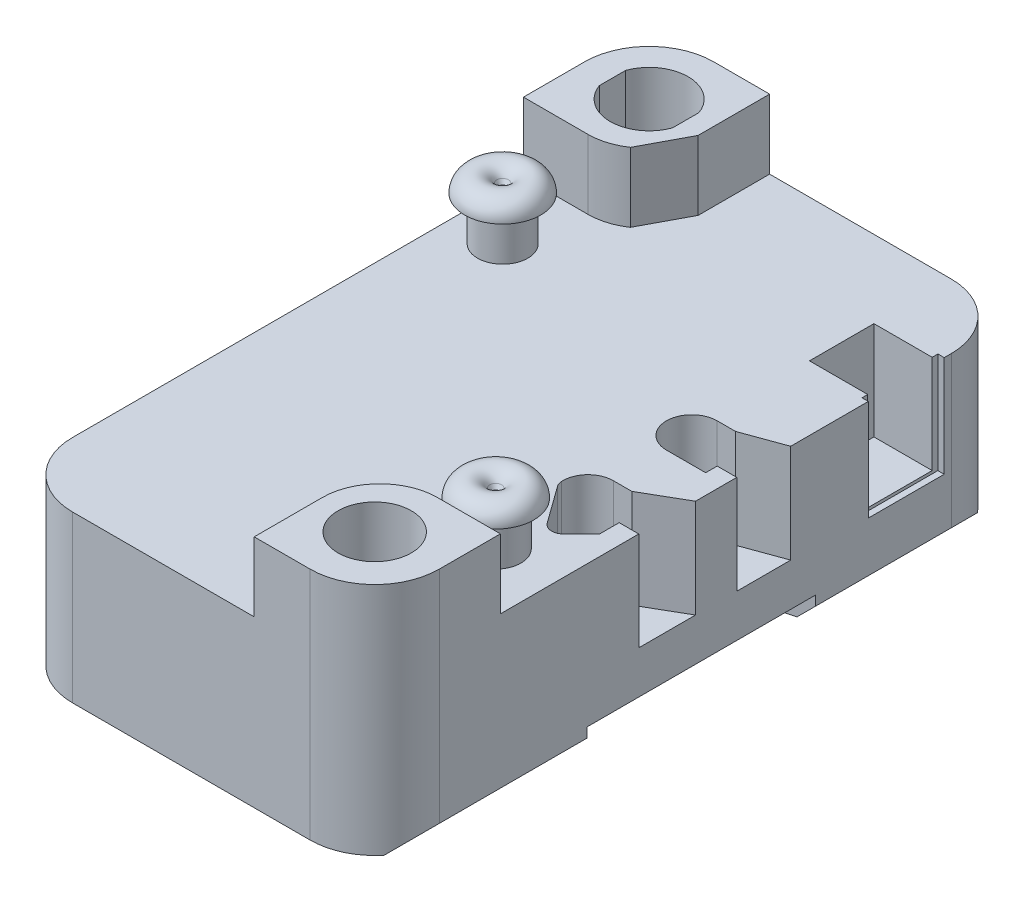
ISO-10303-21;
HEADER;
FILE_DESCRIPTION(('STEP AP214'),'2;1');
FILE_NAME('part.step','',(''),(''),'','','');
FILE_SCHEMA(('AUTOMOTIVE_DESIGN { 1 0 10303 214 1 1 1 1 }'));
ENDSEC;
DATA;
#1=APPLICATION_CONTEXT('core data for automotive mechanical design processes');
#2=APPLICATION_PROTOCOL_DEFINITION('international standard','automotive_design',2000,#1);
#3=PRODUCT_CONTEXT('',#1,'mechanical');
#4=PRODUCT('Part','Part','',(#3));
#5=PRODUCT_RELATED_PRODUCT_CATEGORY('part','',(#4));
#6=PRODUCT_DEFINITION_FORMATION('','',#4);
#7=PRODUCT_DEFINITION_CONTEXT('part definition',#1,'design');
#8=PRODUCT_DEFINITION('design','',#6,#7);
#9=PRODUCT_DEFINITION_SHAPE('','',#8);
#10=(LENGTH_UNIT() NAMED_UNIT(*) SI_UNIT(.MILLI.,.METRE.));
#11=(NAMED_UNIT(*) PLANE_ANGLE_UNIT() SI_UNIT($,.RADIAN.));
#12=(NAMED_UNIT(*) SI_UNIT($,.STERADIAN.) SOLID_ANGLE_UNIT());
#13=UNCERTAINTY_MEASURE_WITH_UNIT(LENGTH_MEASURE(1.E-05),#10,'distance_accuracy_value','');
#14=(GEOMETRIC_REPRESENTATION_CONTEXT(3) GLOBAL_UNCERTAINTY_ASSIGNED_CONTEXT((#13)) GLOBAL_UNIT_ASSIGNED_CONTEXT((#10,
#11,#12)) REPRESENTATION_CONTEXT('',''));
#15=CARTESIAN_POINT('',(0.,0.,0.));
#16=DIRECTION('',(0.,0.,1.));
#17=DIRECTION('',(1.,0.,0.));
#18=AXIS2_PLACEMENT_3D('',#15,#16,#17);
#19=CARTESIAN_POINT('',(0.4,9.27,-5.));
#20=DIRECTION('',(0.,-1.,0.));
#21=DIRECTION('',(0.,0.,-1.));
#22=AXIS2_PLACEMENT_3D('',#19,#20,#21);
#23=PLANE('',#22);
#24=CARTESIAN_POINT('',(-11.0498162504,9.2699999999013,-16.5999908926));
#25=DIRECTION('',(0.,1.,0.));
#26=DIRECTION('',(0.,0.,1.));
#27=AXIS2_PLACEMENT_3D('',#24,#25,#26);
#28=CIRCLE('',#27,0.149999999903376);
#29=CARTESIAN_POINT('',(-11.0498162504,9.2699999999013,-16.4499908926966));
#30=VERTEX_POINT('',#29);
#31=EDGE_CURVE('E22',#30,#30,#28,.T.);
#32=ORIENTED_EDGE('',*,*,#31,.T.);
#33=EDGE_LOOP('',(#32));
#34=FACE_BOUND('',#33,.T.);
#35=ADVANCED_FACE('F18',(#34),#23,.F.);
#36=CARTESIAN_POINT('',(0.4,9.27,-5.));
#37=DIRECTION('',(0.,-1.,0.));
#38=DIRECTION('',(0.,0.,-1.));
#39=AXIS2_PLACEMENT_3D('',#36,#37,#38);
#40=PLANE('',#39);
#41=CARTESIAN_POINT('',(0.25,9.27000000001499,-5.));
#42=DIRECTION('',(0.,1.,0.));
#43=DIRECTION('',(0.,0.,1.));
#44=AXIS2_PLACEMENT_3D('',#41,#42,#43);
#45=CIRCLE('',#44,0.149999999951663);
#46=CARTESIAN_POINT('',(0.25,9.27000000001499,-4.85000000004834));
#47=VERTEX_POINT('',#46);
#48=EDGE_CURVE('E342',#47,#47,#45,.T.);
#49=ORIENTED_EDGE('',*,*,#48,.T.);
#50=EDGE_LOOP('',(#49));
#51=FACE_BOUND('',#50,.T.);
#52=ADVANCED_FACE('F1476',(#51),#40,.F.);
#53=CARTESIAN_POINT('',(-11.8875,0.,-21.6277238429));
#54=DIRECTION('',(1.,0.,0.));
#55=DIRECTION('',(0.,0.,-1.));
#56=AXIS2_PLACEMENT_3D('',#53,#54,#55);
#57=PLANE('',#56);
#58=DIRECTION('',(0.,0.,-1.));
#59=VECTOR('',#58,1.);
#60=CARTESIAN_POINT('',(-11.8875000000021,-0.125,0.));
#61=LINE('',#60,#59);
#62=CARTESIAN_POINT('',(-11.8875000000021,-0.125,-22.7722761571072));
#63=VERTEX_POINT('',#62);
#64=CARTESIAN_POINT('',(-11.8875000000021,-0.125,-21.6277238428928));
#65=VERTEX_POINT('',#64);
#66=EDGE_CURVE('E313',#63,#65,#61,.F.);
#67=ORIENTED_EDGE('',*,*,#66,.F.);
#68=DIRECTION('',(0.,1.,0.));
#69=VECTOR('',#68,1.);
#70=CARTESIAN_POINT('',(-11.8875000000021,5.,-22.7722761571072));
#71=LINE('',#70,#69);
#72=CARTESIAN_POINT('',(-11.887500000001,10.175,-22.7722761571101));
#73=VERTEX_POINT('',#72);
#74=EDGE_CURVE('E317',#63,#73,#71,.T.);
#75=ORIENTED_EDGE('',*,*,#74,.T.);
#76=DIRECTION('',(0.,0.,-1.));
#77=VECTOR('',#76,1.);
#78=CARTESIAN_POINT('',(-11.8875,10.175,-21.6277238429));
#79=LINE('',#78,#77);
#80=CARTESIAN_POINT('',(-11.887500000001,10.175,-21.6277238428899));
#81=VERTEX_POINT('',#80);
#82=EDGE_CURVE('E416',#73,#81,#79,.F.);
#83=ORIENTED_EDGE('',*,*,#82,.T.);
#84=DIRECTION('',(0.,1.,0.));
#85=VECTOR('',#84,1.);
#86=CARTESIAN_POINT('',(-11.8875000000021,5.,-21.6277238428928));
#87=LINE('',#86,#85);
#88=EDGE_CURVE('E320',#81,#65,#87,.F.);
#89=ORIENTED_EDGE('',*,*,#88,.T.);
#90=EDGE_LOOP('',(#67,#75,#83,#89));
#91=FACE_BOUND('',#90,.T.);
#92=ADVANCED_FACE('F315',(#91),#57,.T.);
#93=CARTESIAN_POINT('',(-8.7125,0.,-21.6277238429));
#94=DIRECTION('',(1.,0.,0.));
#95=DIRECTION('',(0.,0.,-1.));
#96=AXIS2_PLACEMENT_3D('',#93,#94,#95);
#97=PLANE('',#96);
#98=DIRECTION('',(0.,1.,0.));
#99=VECTOR('',#98,1.);
#100=CARTESIAN_POINT('',(-8.71249999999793,5.,-22.7722761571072));
#101=LINE('',#100,#99);
#102=CARTESIAN_POINT('',(-8.71249999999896,10.175,-22.7722761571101));
#103=VERTEX_POINT('',#102);
#104=CARTESIAN_POINT('',(-8.71249999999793,-0.125,-22.7722761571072));
#105=VERTEX_POINT('',#104);
#106=EDGE_CURVE('E307',#103,#105,#101,.F.);
#107=ORIENTED_EDGE('',*,*,#106,.T.);
#108=DIRECTION('',(0.,0.,-1.));
#109=VECTOR('',#108,1.);
#110=CARTESIAN_POINT('',(-8.71249999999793,-0.125,0.));
#111=LINE('',#110,#109);
#112=CARTESIAN_POINT('',(-8.71249999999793,-0.125,-21.6277238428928));
#113=VERTEX_POINT('',#112);
#114=EDGE_CURVE('E325',#113,#105,#111,.T.);
#115=ORIENTED_EDGE('',*,*,#114,.F.);
#116=DIRECTION('',(0.,1.,0.));
#117=VECTOR('',#116,1.);
#118=CARTESIAN_POINT('',(-8.71249999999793,5.,-21.6277238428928));
#119=LINE('',#118,#117);
#120=CARTESIAN_POINT('',(-8.71249999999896,10.175,-21.6277238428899));
#121=VERTEX_POINT('',#120);
#122=EDGE_CURVE('E600',#113,#121,#119,.T.);
#123=ORIENTED_EDGE('',*,*,#122,.T.);
#124=DIRECTION('',(0.,0.,-1.));
#125=VECTOR('',#124,1.);
#126=CARTESIAN_POINT('',(-8.7125,10.175,-21.6277238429));
#127=LINE('',#126,#125);
#128=EDGE_CURVE('E396',#103,#121,#127,.F.);
#129=ORIENTED_EDGE('',*,*,#128,.F.);
#130=EDGE_LOOP('',(#107,#115,#123,#129));
#131=FACE_BOUND('',#130,.T.);
#132=ADVANCED_FACE('F937',(#131),#97,.F.);
#133=CARTESIAN_POINT('',(0.,-0.125,0.));
#134=DIRECTION('',(0.,-1.,0.));
#135=DIRECTION('',(0.,0.,-1.));
#136=AXIS2_PLACEMENT_3D('',#133,#134,#135);
#137=PLANE('',#136);
#138=CARTESIAN_POINT('',(-10.3,-0.125,-22.2));
#139=DIRECTION('',(0.,1.,0.));
#140=DIRECTION('',(0.,0.,1.));
#141=AXIS2_PLACEMENT_3D('',#138,#139,#140);
#142=CIRCLE('',#141,1.6875);
#143=EDGE_CURVE('E328',#105,#63,#142,.T.);
#144=ORIENTED_EDGE('',*,*,#143,.T.);
#145=ORIENTED_EDGE('',*,*,#66,.T.);
#146=CARTESIAN_POINT('',(-10.3,-0.125,-22.2));
#147=DIRECTION('',(0.,1.,0.));
#148=DIRECTION('',(0.,0.,1.));
#149=AXIS2_PLACEMENT_3D('',#146,#147,#148);
#150=CIRCLE('',#149,1.6875);
#151=EDGE_CURVE('E337',#65,#113,#150,.T.);
#152=ORIENTED_EDGE('',*,*,#151,.T.);
#153=ORIENTED_EDGE('',*,*,#114,.T.);
#154=EDGE_LOOP('',(#144,#145,#152,#153));
#155=FACE_BOUND('',#154,.T.);
#156=DIRECTION('',(1.,0.,0.));
#157=VECTOR('',#156,1.);
#158=CARTESIAN_POINT('',(-7.4,-0.125,-24.75));
#159=LINE('',#158,#157);
#160=CARTESIAN_POINT('',(-10.3,-0.125,-24.75));
#161=VERTEX_POINT('',#160);
#162=CARTESIAN_POINT('',(-7.4,-0.125,-24.75));
#163=VERTEX_POINT('',#162);
#164=EDGE_CURVE('E397',#161,#163,#159,.T.);
#165=ORIENTED_EDGE('',*,*,#164,.T.);
#166=DIRECTION('',(0.,0.,1.));
#167=VECTOR('',#166,1.);
#168=CARTESIAN_POINT('',(-7.4,-0.125,-22.2));
#169=LINE('',#168,#167);
#170=CARTESIAN_POINT('',(-7.4,-0.125,-22.2));
#171=VERTEX_POINT('',#170);
#172=EDGE_CURVE('E389',#163,#171,#169,.T.);
#173=ORIENTED_EDGE('',*,*,#172,.T.);
#174=CARTESIAN_POINT('',(-10.3,-0.125,-22.2));
#175=DIRECTION('',(0.,1.,0.));
#176=DIRECTION('',(0.,0.,1.));
#177=AXIS2_PLACEMENT_3D('',#174,#175,#176);
#178=CIRCLE('',#177,2.9);
#179=CARTESIAN_POINT('',(-10.3,-0.125,-19.3));
#180=VERTEX_POINT('',#179);
#181=EDGE_CURVE('E596',#180,#171,#178,.T.);
#182=ORIENTED_EDGE('',*,*,#181,.F.);
#183=DIRECTION('',(-1.,0.,0.));
#184=VECTOR('',#183,1.);
#185=CARTESIAN_POINT('',(-12.85,-0.125,-19.3));
#186=LINE('',#185,#184);
#187=CARTESIAN_POINT('',(-12.85,-0.125,-19.3));
#188=VERTEX_POINT('',#187);
#189=EDGE_CURVE('E409',#180,#188,#186,.T.);
#190=ORIENTED_EDGE('',*,*,#189,.T.);
#191=DIRECTION('',(0.,0.,-1.));
#192=VECTOR('',#191,1.);
#193=CARTESIAN_POINT('',(-12.85,-0.125,-22.2));
#194=LINE('',#193,#192);
#195=CARTESIAN_POINT('',(-12.85,-0.125,-22.2));
#196=VERTEX_POINT('',#195);
#197=EDGE_CURVE('E403',#188,#196,#194,.T.);
#198=ORIENTED_EDGE('',*,*,#197,.T.);
#199=CARTESIAN_POINT('',(-10.3,-0.125,-22.2));
#200=DIRECTION('',(0.,1.,0.));
#201=DIRECTION('',(0.,0.,1.));
#202=AXIS2_PLACEMENT_3D('',#199,#200,#201);
#203=CIRCLE('',#202,2.55);
#204=EDGE_CURVE('E405',#161,#196,#203,.T.);
#205=ORIENTED_EDGE('',*,*,#204,.F.);
#206=EDGE_LOOP('',(#165,#173,#182,#190,#198,#205));
#207=FACE_BOUND('',#206,.T.);
#208=ADVANCED_FACE('F329',(#155,#207),#137,.T.);
#209=CARTESIAN_POINT('',(0.,0.345,0.));
#210=DIRECTION('',(0.,-1.,0.));
#211=DIRECTION('',(0.,0.,-1.));
#212=AXIS2_PLACEMENT_3D('',#209,#210,#211);
#213=PLANE('',#212);
#214=CARTESIAN_POINT('',(0.25,0.345,-13.5));
#215=DIRECTION('',(0.,1.,0.));
#216=DIRECTION('',(0.,0.,1.));
#217=AXIS2_PLACEMENT_3D('',#214,#215,#216);
#218=CIRCLE('',#217,0.95);
#219=CARTESIAN_POINT('',(0.249999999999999,0.345,-14.45));
#220=VERTEX_POINT('',#219);
#221=CARTESIAN_POINT('',(0.25,0.345,-12.55));
#222=VERTEX_POINT('',#221);
#223=EDGE_CURVE('E577',#220,#222,#218,.T.);
#224=ORIENTED_EDGE('',*,*,#223,.F.);
#225=DIRECTION('',(0.,0.,1.));
#226=VECTOR('',#225,1.);
#227=CARTESIAN_POINT('',(0.25,0.345,-9.));
#228=LINE('',#227,#226);
#229=EDGE_CURVE('E324',#222,#220,#228,.F.);
#230=ORIENTED_EDGE('',*,*,#229,.F.);
#231=EDGE_LOOP('',(#224,#230));
#232=FACE_BOUND('',#231,.T.);
#233=ADVANCED_FACE('F1462',(#232),#213,.T.);
#234=CARTESIAN_POINT('',(1.2,0.635444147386,-9.));
#235=DIRECTION('',(0.292371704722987,-0.956304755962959,0.));
#236=DIRECTION('',(0.956304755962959,0.292371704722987,0.));
#237=AXIS2_PLACEMENT_3D('',#234,#235,#236);
#238=PLANE('',#237);
#239=ORIENTED_EDGE('',*,*,#229,.T.);
#240=CARTESIAN_POINT('',(0.25,0.345,-13.5));
#241=DIRECTION('',(0.292371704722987,-0.956304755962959,0.));
#242=DIRECTION('',(0.956304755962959,0.292371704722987,0.));
#243=AXIS2_PLACEMENT_3D('',#240,#241,#242);
#244=ELLIPSE('',#243,0.99340716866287,0.95);
#245=EDGE_CURVE('E574',#222,#220,#244,.F.);
#246=ORIENTED_EDGE('',*,*,#245,.F.);
#247=EDGE_LOOP('',(#239,#246));
#248=FACE_BOUND('',#247,.T.);
#249=ADVANCED_FACE('F1468',(#248),#238,.T.);
#250=CARTESIAN_POINT('',(0.,0.345,0.));
#251=DIRECTION('',(0.,-1.,0.));
#252=DIRECTION('',(0.,0.,-1.));
#253=AXIS2_PLACEMENT_3D('',#250,#251,#252);
#254=PLANE('',#253);
#255=CARTESIAN_POINT('',(0.25,0.345,-9.));
#256=DIRECTION('',(0.,1.,0.));
#257=DIRECTION('',(0.,0.,1.));
#258=AXIS2_PLACEMENT_3D('',#255,#256,#257);
#259=CIRCLE('',#258,0.95);
#260=CARTESIAN_POINT('',(0.249999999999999,0.345,-9.95));
#261=VERTEX_POINT('',#260);
#262=CARTESIAN_POINT('',(0.25,0.345,-8.05));
#263=VERTEX_POINT('',#262);
#264=EDGE_CURVE('E571',#261,#263,#259,.T.);
#265=ORIENTED_EDGE('',*,*,#264,.F.);
#266=DIRECTION('',(0.,0.,1.));
#267=VECTOR('',#266,1.);
#268=CARTESIAN_POINT('',(0.25,0.345,-9.));
#269=LINE('',#268,#267);
#270=EDGE_CURVE('E365',#263,#261,#269,.F.);
#271=ORIENTED_EDGE('',*,*,#270,.F.);
#272=EDGE_LOOP('',(#265,#271));
#273=FACE_BOUND('',#272,.T.);
#274=ADVANCED_FACE('F621',(#273),#254,.T.);
#275=CARTESIAN_POINT('',(1.2,0.635444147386,-9.));
#276=DIRECTION('',(0.292371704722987,-0.956304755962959,0.));
#277=DIRECTION('',(0.956304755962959,0.292371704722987,0.));
#278=AXIS2_PLACEMENT_3D('',#275,#276,#277);
#279=PLANE('',#278);
#280=ORIENTED_EDGE('',*,*,#270,.T.);
#281=CARTESIAN_POINT('',(0.25,0.345,-9.));
#282=DIRECTION('',(0.292371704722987,-0.956304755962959,0.));
#283=DIRECTION('',(0.956304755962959,0.292371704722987,0.));
#284=AXIS2_PLACEMENT_3D('',#281,#282,#283);
#285=ELLIPSE('',#284,0.99340716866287,0.95);
#286=EDGE_CURVE('E568',#263,#261,#285,.F.);
#287=ORIENTED_EDGE('',*,*,#286,.F.);
#288=EDGE_LOOP('',(#280,#287));
#289=FACE_BOUND('',#288,.T.);
#290=ADVANCED_FACE('F611',(#289),#279,.T.);
#291=CARTESIAN_POINT('',(-11.0498162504,9.44482396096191,-16.5999908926));
#292=DIRECTION('',(0.,1.,0.));
#293=DIRECTION('',(0.,0.,1.));
#294=AXIS2_PLACEMENT_3D('',#291,#292,#293);
#295=CONICAL_SURFACE('',#294,0.250934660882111,0.523598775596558);
#296=CARTESIAN_POINT('',(-11.0498162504,9.44482396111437,-16.5999908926));
#297=DIRECTION('',(0.,-1.,0.));
#298=DIRECTION('',(0.,0.,-1.));
#299=AXIS2_PLACEMENT_3D('',#296,#297,#298);
#300=CIRCLE('',#299,0.250934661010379);
#301=CARTESIAN_POINT('',(-11.0498162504,9.44482396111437,-16.8509255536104));
#302=VERTEX_POINT('',#301);
#303=EDGE_CURVE('E361',#302,#302,#300,.T.);
#304=ORIENTED_EDGE('',*,*,#303,.F.);
#305=EDGE_LOOP('',(#304));
#306=FACE_BOUND('',#305,.T.);
#307=ORIENTED_EDGE('',*,*,#31,.F.);
#308=EDGE_LOOP('',(#307));
#309=FACE_BOUND('',#308,.T.);
#310=ADVANCED_FACE('F608',(#306,#309),#295,.F.);
#311=CARTESIAN_POINT('',(0.25,9.44482396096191,-5.));
#312=DIRECTION('',(0.,1.,0.));
#313=DIRECTION('',(0.,0.,1.));
#314=AXIS2_PLACEMENT_3D('',#311,#312,#313);
#315=CONICAL_SURFACE('',#314,0.250934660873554,0.523598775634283);
#316=CARTESIAN_POINT('',(0.25,9.44482396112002,-5.));
#317=DIRECTION('',(0.,-1.,0.));
#318=DIRECTION('',(0.,0.,-1.));
#319=AXIS2_PLACEMENT_3D('',#316,#317,#318);
#320=CIRCLE('',#319,0.250934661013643);
#321=CARTESIAN_POINT('',(0.25,9.44482396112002,-5.25093466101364));
#322=VERTEX_POINT('',#321);
#323=EDGE_CURVE('E357',#322,#322,#320,.T.);
#324=ORIENTED_EDGE('',*,*,#323,.F.);
#325=EDGE_LOOP('',(#324));
#326=FACE_BOUND('',#325,.T.);
#327=ORIENTED_EDGE('',*,*,#48,.F.);
#328=EDGE_LOOP('',(#327));
#329=FACE_BOUND('',#328,.T.);
#330=ADVANCED_FACE('F610',(#326,#329),#315,.F.);
#331=CARTESIAN_POINT('',(-10.3,5.,-22.2));
#332=DIRECTION('',(0.,1.,0.));
#333=DIRECTION('',(0.,0.,1.));
#334=AXIS2_PLACEMENT_3D('',#331,#332,#333);
#335=CYLINDRICAL_SURFACE('',#334,1.6875);
#336=ORIENTED_EDGE('',*,*,#74,.F.);
#337=ORIENTED_EDGE('',*,*,#143,.F.);
#338=ORIENTED_EDGE('',*,*,#106,.F.);
#339=CARTESIAN_POINT('',(-10.3,10.175,-22.2));
#340=DIRECTION('',(0.,1.,0.));
#341=DIRECTION('',(0.,0.,1.));
#342=AXIS2_PLACEMENT_3D('',#339,#340,#341);
#343=CIRCLE('',#342,1.6875);
#344=EDGE_CURVE('E335',#73,#103,#343,.F.);
#345=ORIENTED_EDGE('',*,*,#344,.F.);
#346=EDGE_LOOP('',(#336,#337,#338,#345));
#347=FACE_BOUND('',#346,.T.);
#348=ADVANCED_FACE('F333',(#347),#335,.F.);
#349=CARTESIAN_POINT('',(-10.3,5.,-22.2));
#350=DIRECTION('',(0.,1.,0.));
#351=DIRECTION('',(0.,0.,1.));
#352=AXIS2_PLACEMENT_3D('',#349,#350,#351);
#353=CYLINDRICAL_SURFACE('',#352,1.6875);
#354=ORIENTED_EDGE('',*,*,#122,.F.);
#355=ORIENTED_EDGE('',*,*,#151,.F.);
#356=ORIENTED_EDGE('',*,*,#88,.F.);
#357=CARTESIAN_POINT('',(-10.3,10.175,-22.2));
#358=DIRECTION('',(0.,1.,0.));
#359=DIRECTION('',(0.,0.,1.));
#360=AXIS2_PLACEMENT_3D('',#357,#358,#359);
#361=CIRCLE('',#360,1.6875);
#362=EDGE_CURVE('E558',#121,#81,#361,.F.);
#363=ORIENTED_EDGE('',*,*,#362,.F.);
#364=EDGE_LOOP('',(#354,#355,#356,#363));
#365=FACE_BOUND('',#364,.T.);
#366=ADVANCED_FACE('F920',(#365),#353,.F.);
#367=CARTESIAN_POINT('',(0.,-0.0625,0.));
#368=DIRECTION('',(0.,1.,0.));
#369=DIRECTION('',(0.,0.,1.));
#370=AXIS2_PLACEMENT_3D('',#367,#368,#369);
#371=CYLINDRICAL_SURFACE('',#370,2.55);
#372=CARTESIAN_POINT('',(0.,0.,0.));
#373=DIRECTION('',(0.,1.,0.));
#374=DIRECTION('',(0.,0.,1.));
#375=AXIS2_PLACEMENT_3D('',#372,#373,#374);
#376=CIRCLE('',#375,2.55);
#377=CARTESIAN_POINT('',(2.175,0.,1.33111795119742));
#378=VERTEX_POINT('',#377);
#379=CARTESIAN_POINT('',(0.,0.,2.55));
#380=VERTEX_POINT('',#379);
#381=EDGE_CURVE('E552',#378,#380,#376,.F.);
#382=ORIENTED_EDGE('',*,*,#381,.T.);
#383=DIRECTION('',(0.,1.,0.));
#384=VECTOR('',#383,1.);
#385=CARTESIAN_POINT('',(0.,0.,2.55));
#386=LINE('',#385,#384);
#387=CARTESIAN_POINT('',(0.,-0.125,2.55));
#388=VERTEX_POINT('',#387);
#389=EDGE_CURVE('E927',#380,#388,#386,.F.);
#390=ORIENTED_EDGE('',*,*,#389,.T.);
#391=CARTESIAN_POINT('',(0.,-0.125,0.));
#392=DIRECTION('',(0.,1.,0.));
#393=DIRECTION('',(0.,0.,1.));
#394=AXIS2_PLACEMENT_3D('',#391,#392,#393);
#395=CIRCLE('',#394,2.55);
#396=CARTESIAN_POINT('',(2.05,-0.125,1.51657508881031));
#397=VERTEX_POINT('',#396);
#398=EDGE_CURVE('E589',#397,#388,#395,.F.);
#399=ORIENTED_EDGE('',*,*,#398,.F.);
#400=CARTESIAN_POINT('',(2.05,-0.125,1.51657508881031));
#401=CARTESIAN_POINT('',(2.05558085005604,-0.119419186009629,1.50903128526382));
#402=CARTESIAN_POINT('',(2.06113095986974,-0.113869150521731,1.5014419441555));
#403=CARTESIAN_POINT('',(2.07213324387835,-0.102867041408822,1.48622052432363));
#404=CARTESIAN_POINT('',(2.07758581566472,-0.0974145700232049,1.47858902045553));
#405=CARTESIAN_POINT('',(2.08839297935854,-0.0866075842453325,1.46328464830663));
#406=CARTESIAN_POINT('',(2.0937479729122,-0.0812526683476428,1.45561234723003));
#407=CARTESIAN_POINT('',(2.10435994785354,-0.0706407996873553,1.44022775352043));
#408=CARTESIAN_POINT('',(2.10961733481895,-0.0653834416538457,1.43251602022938));
#409=CARTESIAN_POINT('',(2.12003408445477,-0.0549666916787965,1.41705392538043));
#410=CARTESIAN_POINT('',(2.12519385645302,-0.0498068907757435,1.40930411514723));
#411=CARTESIAN_POINT('',(2.13541538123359,-0.0395852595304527,1.39376722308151));
#412=CARTESIAN_POINT('',(2.14047754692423,-0.0345230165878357,1.38598068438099));
#413=CARTESIAN_POINT('',(2.15050388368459,-0.0244965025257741,1.37037168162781));
#414=CARTESIAN_POINT('',(2.15546847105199,-0.0195318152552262,1.36254975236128));
#415=CARTESIAN_POINT('',(2.16529968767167,-0.00970042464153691,1.34687131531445));
#416=CARTESIAN_POINT('',(2.1701667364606,-0.00483330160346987,1.33901533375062));
#417=CARTESIAN_POINT('',(2.175,0.,1.33111795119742));
#418=B_SPLINE_CURVE_WITH_KNOTS('',3,(#400,#401,#402,#403,#404,#405,#406,#407,#408,#409,#410,
#411,#412,#413,#414,#415,#416,#417),.UNSPECIFIED.,.F.,.F.,(4,2,2,2,2,2,2,2,4),(0.,
0.0327535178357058,0.0652996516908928,0.097639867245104,0.129775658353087,0.16170854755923,
0.19344008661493,0.224971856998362,0.256305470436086),.UNSPECIFIED.);
#419=EDGE_CURVE('E924',#397,#378,#418,.T.);
#420=ORIENTED_EDGE('',*,*,#419,.T.);
#421=EDGE_LOOP('',(#382,#390,#399,#420));
#422=FACE_BOUND('',#421,.T.);
#423=ADVANCED_FACE('F915',(#422),#371,.T.);
#424=CARTESIAN_POINT('',(-2.9,0.,2.55));
#425=DIRECTION('',(0.,0.,-1.));
#426=DIRECTION('',(-1.,0.,0.));
#427=AXIS2_PLACEMENT_3D('',#424,#425,#426);
#428=PLANE('',#427);
#429=DIRECTION('',(0.,1.,0.));
#430=VECTOR('',#429,1.);
#431=CARTESIAN_POINT('',(-2.9,0.,2.55));
#432=LINE('',#431,#430);
#433=CARTESIAN_POINT('',(-2.9,0.,2.55));
#434=VERTEX_POINT('',#433);
#435=CARTESIAN_POINT('',(-2.9,-0.125,2.55));
#436=VERTEX_POINT('',#435);
#437=EDGE_CURVE('E1380',#434,#436,#432,.F.);
#438=ORIENTED_EDGE('',*,*,#437,.T.);
#439=DIRECTION('',(1.,0.,0.));
#440=VECTOR('',#439,1.);
#441=CARTESIAN_POINT('',(0.,-0.125,2.55));
#442=LINE('',#441,#440);
#443=EDGE_CURVE('E592',#388,#436,#442,.F.);
#444=ORIENTED_EDGE('',*,*,#443,.F.);
#445=ORIENTED_EDGE('',*,*,#389,.F.);
#446=DIRECTION('',(1.,0.,0.));
#447=VECTOR('',#446,1.);
#448=CARTESIAN_POINT('',(0.,0.,2.55));
#449=LINE('',#448,#447);
#450=EDGE_CURVE('E554',#380,#434,#449,.F.);
#451=ORIENTED_EDGE('',*,*,#450,.T.);
#452=EDGE_LOOP('',(#438,#444,#445,#451));
#453=FACE_BOUND('',#452,.T.);
#454=ADVANCED_FACE('F911',(#453),#428,.F.);
#455=CARTESIAN_POINT('',(-2.9,0.,0.));
#456=DIRECTION('',(1.,0.,0.));
#457=DIRECTION('',(0.,0.,-1.));
#458=AXIS2_PLACEMENT_3D('',#455,#456,#457);
#459=PLANE('',#458);
#460=DIRECTION('',(0.,1.,0.));
#461=VECTOR('',#460,1.);
#462=CARTESIAN_POINT('',(-2.9,-0.0625,0.));
#463=LINE('',#462,#461);
#464=CARTESIAN_POINT('',(-2.9,-0.125,0.));
#465=VERTEX_POINT('',#464);
#466=CARTESIAN_POINT('',(-2.9,0.,0.));
#467=VERTEX_POINT('',#466);
#468=EDGE_CURVE('E1375',#465,#467,#463,.T.);
#469=ORIENTED_EDGE('',*,*,#468,.F.);
#470=DIRECTION('',(0.,0.,-1.));
#471=VECTOR('',#470,1.);
#472=CARTESIAN_POINT('',(-2.9,-0.125,0.));
#473=LINE('',#472,#471);
#474=EDGE_CURVE('E588',#436,#465,#473,.T.);
#475=ORIENTED_EDGE('',*,*,#474,.F.);
#476=ORIENTED_EDGE('',*,*,#437,.F.);
#477=DIRECTION('',(0.,0.,1.));
#478=VECTOR('',#477,1.);
#479=CARTESIAN_POINT('',(-2.9,0.,0.));
#480=LINE('',#479,#478);
#481=EDGE_CURVE('E551',#434,#467,#480,.F.);
#482=ORIENTED_EDGE('',*,*,#481,.T.);
#483=EDGE_LOOP('',(#469,#475,#476,#482));
#484=FACE_BOUND('',#483,.T.);
#485=ADVANCED_FACE('F907',(#484),#459,.F.);
#486=CARTESIAN_POINT('',(0.,-0.0625,0.));
#487=DIRECTION('',(0.,1.,0.));
#488=DIRECTION('',(0.,0.,1.));
#489=AXIS2_PLACEMENT_3D('',#486,#487,#488);
#490=CYLINDRICAL_SURFACE('',#489,2.9);
#491=ORIENTED_EDGE('',*,*,#468,.T.);
#492=CARTESIAN_POINT('',(0.,0.,0.));
#493=DIRECTION('',(0.,1.,0.));
#494=DIRECTION('',(0.,0.,1.));
#495=AXIS2_PLACEMENT_3D('',#492,#493,#494);
#496=CIRCLE('',#495,2.9);
#497=CARTESIAN_POINT('',(0.,0.,-2.9));
#498=VERTEX_POINT('',#497);
#499=EDGE_CURVE('E548',#467,#498,#496,.F.);
#500=ORIENTED_EDGE('',*,*,#499,.T.);
#501=DIRECTION('',(0.,1.,0.));
#502=VECTOR('',#501,1.);
#503=CARTESIAN_POINT('',(0.,0.,-2.9));
#504=LINE('',#503,#502);
#505=CARTESIAN_POINT('',(0.,-0.125,-2.9));
#506=VERTEX_POINT('',#505);
#507=EDGE_CURVE('E599',#498,#506,#504,.F.);
#508=ORIENTED_EDGE('',*,*,#507,.T.);
#509=CARTESIAN_POINT('',(0.,-0.125,0.));
#510=DIRECTION('',(0.,1.,0.));
#511=DIRECTION('',(0.,0.,1.));
#512=AXIS2_PLACEMENT_3D('',#509,#510,#511);
#513=CIRCLE('',#512,2.9);
#514=EDGE_CURVE('E585',#465,#506,#513,.F.);
#515=ORIENTED_EDGE('',*,*,#514,.F.);
#516=EDGE_LOOP('',(#491,#500,#508,#515));
#517=FACE_BOUND('',#516,.T.);
#518=ADVANCED_FACE('F903',(#517),#490,.T.);
#519=CARTESIAN_POINT('',(2.55,0.,-2.9));
#520=DIRECTION('',(0.,0.,1.));
#521=DIRECTION('',(1.,0.,0.));
#522=AXIS2_PLACEMENT_3D('',#519,#520,#521);
#523=PLANE('',#522);
#524=ORIENTED_EDGE('',*,*,#507,.F.);
#525=DIRECTION('',(1.,0.,0.));
#526=VECTOR('',#525,1.);
#527=CARTESIAN_POINT('',(0.,0.,-2.9));
#528=LINE('',#527,#526);
#529=CARTESIAN_POINT('',(2.175,0.,-2.9));
#530=VERTEX_POINT('',#529);
#531=EDGE_CURVE('E550',#498,#530,#528,.T.);
#532=ORIENTED_EDGE('',*,*,#531,.T.);
#533=DIRECTION('',(0.707106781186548,0.707106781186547,0.));
#534=VECTOR('',#533,1.);
#535=CARTESIAN_POINT('',(2.05,-0.125,-2.9));
#536=LINE('',#535,#534);
#537=CARTESIAN_POINT('',(2.05,-0.125,-2.9));
#538=VERTEX_POINT('',#537);
#539=EDGE_CURVE('E1372',#538,#530,#536,.T.);
#540=ORIENTED_EDGE('',*,*,#539,.F.);
#541=DIRECTION('',(1.,0.,0.));
#542=VECTOR('',#541,1.);
#543=CARTESIAN_POINT('',(0.,-0.125,-2.9));
#544=LINE('',#543,#542);
#545=EDGE_CURVE('E373',#506,#538,#544,.T.);
#546=ORIENTED_EDGE('',*,*,#545,.F.);
#547=EDGE_LOOP('',(#524,#532,#540,#546));
#548=FACE_BOUND('',#547,.T.);
#549=ADVANCED_FACE('F899',(#548),#523,.F.);
#550=CARTESIAN_POINT('',(-10.3,-0.0625,-22.2));
#551=DIRECTION('',(0.,1.,0.));
#552=DIRECTION('',(0.,0.,1.));
#553=AXIS2_PLACEMENT_3D('',#550,#551,#552);
#554=CYLINDRICAL_SURFACE('',#553,2.9);
#555=DIRECTION('',(0.,1.,0.));
#556=VECTOR('',#555,1.);
#557=CARTESIAN_POINT('',(-7.4,0.,-22.2));
#558=LINE('',#557,#556);
#559=CARTESIAN_POINT('',(-7.4,0.,-22.2));
#560=VERTEX_POINT('',#559);
#561=EDGE_CURVE('E391',#171,#560,#558,.T.);
#562=ORIENTED_EDGE('',*,*,#561,.T.);
#563=CARTESIAN_POINT('',(-10.3,0.,-22.2));
#564=DIRECTION('',(0.,1.,0.));
#565=DIRECTION('',(0.,0.,1.));
#566=AXIS2_PLACEMENT_3D('',#563,#564,#565);
#567=CIRCLE('',#566,2.9);
#568=CARTESIAN_POINT('',(-10.3,0.,-19.3));
#569=VERTEX_POINT('',#568);
#570=EDGE_CURVE('E531',#560,#569,#567,.F.);
#571=ORIENTED_EDGE('',*,*,#570,.T.);
#572=DIRECTION('',(0.,1.,0.));
#573=VECTOR('',#572,1.);
#574=CARTESIAN_POINT('',(-10.3,0.,-19.3));
#575=LINE('',#574,#573);
#576=EDGE_CURVE('E412',#569,#180,#575,.F.);
#577=ORIENTED_EDGE('',*,*,#576,.T.);
#578=ORIENTED_EDGE('',*,*,#181,.T.);
#579=EDGE_LOOP('',(#562,#571,#577,#578));
#580=FACE_BOUND('',#579,.T.);
#581=ADVANCED_FACE('F895',(#580),#554,.T.);
#582=CARTESIAN_POINT('',(-12.85,0.,-19.3));
#583=DIRECTION('',(0.,0.,-1.));
#584=DIRECTION('',(-1.,0.,0.));
#585=AXIS2_PLACEMENT_3D('',#582,#583,#584);
#586=PLANE('',#585);
#587=DIRECTION('',(0.,1.,0.));
#588=VECTOR('',#587,1.);
#589=CARTESIAN_POINT('',(-12.85,0.,-19.3));
#590=LINE('',#589,#588);
#591=CARTESIAN_POINT('',(-12.85,0.,-19.3));
#592=VERTEX_POINT('',#591);
#593=EDGE_CURVE('E406',#592,#188,#590,.F.);
#594=ORIENTED_EDGE('',*,*,#593,.T.);
#595=ORIENTED_EDGE('',*,*,#189,.F.);
#596=ORIENTED_EDGE('',*,*,#576,.F.);
#597=DIRECTION('',(1.,0.,0.));
#598=VECTOR('',#597,1.);
#599=CARTESIAN_POINT('',(0.,0.,-19.3));
#600=LINE('',#599,#598);
#601=EDGE_CURVE('E533',#569,#592,#600,.F.);
#602=ORIENTED_EDGE('',*,*,#601,.T.);
#603=EDGE_LOOP('',(#594,#595,#596,#602));
#604=FACE_BOUND('',#603,.T.);
#605=ADVANCED_FACE('F891',(#604),#586,.F.);
#606=CARTESIAN_POINT('',(-12.85,0.,-22.2));
#607=DIRECTION('',(1.,0.,0.));
#608=DIRECTION('',(0.,0.,-1.));
#609=AXIS2_PLACEMENT_3D('',#606,#607,#608);
#610=PLANE('',#609);
#611=DIRECTION('',(0.,1.,0.));
#612=VECTOR('',#611,1.);
#613=CARTESIAN_POINT('',(-12.85,-0.0625,-22.2));
#614=LINE('',#613,#612);
#615=CARTESIAN_POINT('',(-12.85,0.,-22.2));
#616=VERTEX_POINT('',#615);
#617=EDGE_CURVE('E595',#196,#616,#614,.T.);
#618=ORIENTED_EDGE('',*,*,#617,.F.);
#619=ORIENTED_EDGE('',*,*,#197,.F.);
#620=ORIENTED_EDGE('',*,*,#593,.F.);
#621=DIRECTION('',(0.,0.,1.));
#622=VECTOR('',#621,1.);
#623=CARTESIAN_POINT('',(-12.85,0.,0.));
#624=LINE('',#623,#622);
#625=EDGE_CURVE('E530',#592,#616,#624,.F.);
#626=ORIENTED_EDGE('',*,*,#625,.T.);
#627=EDGE_LOOP('',(#618,#619,#620,#626));
#628=FACE_BOUND('',#627,.T.);
#629=ADVANCED_FACE('F887',(#628),#610,.F.);
#630=CARTESIAN_POINT('',(-10.3,-0.0625,-22.2));
#631=DIRECTION('',(0.,1.,0.));
#632=DIRECTION('',(0.,0.,1.));
#633=AXIS2_PLACEMENT_3D('',#630,#631,#632);
#634=CYLINDRICAL_SURFACE('',#633,2.55);
#635=ORIENTED_EDGE('',*,*,#617,.T.);
#636=CARTESIAN_POINT('',(-10.3,0.,-22.2));
#637=DIRECTION('',(0.,1.,0.));
#638=DIRECTION('',(0.,0.,1.));
#639=AXIS2_PLACEMENT_3D('',#636,#637,#638);
#640=CIRCLE('',#639,2.55);
#641=CARTESIAN_POINT('',(-10.3,0.,-24.75));
#642=VERTEX_POINT('',#641);
#643=EDGE_CURVE('E527',#616,#642,#640,.F.);
#644=ORIENTED_EDGE('',*,*,#643,.T.);
#645=DIRECTION('',(0.,1.,0.));
#646=VECTOR('',#645,1.);
#647=CARTESIAN_POINT('',(-10.3,0.,-24.75));
#648=LINE('',#647,#646);
#649=EDGE_CURVE('E400',#642,#161,#648,.F.);
#650=ORIENTED_EDGE('',*,*,#649,.T.);
#651=ORIENTED_EDGE('',*,*,#204,.T.);
#652=EDGE_LOOP('',(#635,#644,#650,#651));
#653=FACE_BOUND('',#652,.T.);
#654=ADVANCED_FACE('F883',(#653),#634,.T.);
#655=CARTESIAN_POINT('',(-7.4,0.,-24.75));
#656=DIRECTION('',(0.,0.,1.));
#657=DIRECTION('',(1.,0.,0.));
#658=AXIS2_PLACEMENT_3D('',#655,#656,#657);
#659=PLANE('',#658);
#660=DIRECTION('',(0.,1.,0.));
#661=VECTOR('',#660,1.);
#662=CARTESIAN_POINT('',(-7.4,0.,-24.75));
#663=LINE('',#662,#661);
#664=CARTESIAN_POINT('',(-7.4,0.,-24.75));
#665=VERTEX_POINT('',#664);
#666=EDGE_CURVE('E392',#665,#163,#663,.F.);
#667=ORIENTED_EDGE('',*,*,#666,.T.);
#668=ORIENTED_EDGE('',*,*,#164,.F.);
#669=ORIENTED_EDGE('',*,*,#649,.F.);
#670=DIRECTION('',(1.,0.,0.));
#671=VECTOR('',#670,1.);
#672=CARTESIAN_POINT('',(0.,0.,-24.75));
#673=LINE('',#672,#671);
#674=EDGE_CURVE('E529',#642,#665,#673,.T.);
#675=ORIENTED_EDGE('',*,*,#674,.T.);
#676=EDGE_LOOP('',(#667,#668,#669,#675));
#677=FACE_BOUND('',#676,.T.);
#678=ADVANCED_FACE('F879',(#677),#659,.F.);
#679=CARTESIAN_POINT('',(-7.4,0.,-22.2));
#680=DIRECTION('',(-1.,0.,0.));
#681=DIRECTION('',(0.,0.,1.));
#682=AXIS2_PLACEMENT_3D('',#679,#680,#681);
#683=PLANE('',#682);
#684=ORIENTED_EDGE('',*,*,#561,.F.);
#685=ORIENTED_EDGE('',*,*,#172,.F.);
#686=ORIENTED_EDGE('',*,*,#666,.F.);
#687=DIRECTION('',(0.,0.,1.));
#688=VECTOR('',#687,1.);
#689=CARTESIAN_POINT('',(-7.4,0.,0.));
#690=LINE('',#689,#688);
#691=EDGE_CURVE('E1147',#665,#560,#690,.T.);
#692=ORIENTED_EDGE('',*,*,#691,.T.);
#693=EDGE_LOOP('',(#684,#685,#686,#692));
#694=FACE_BOUND('',#693,.T.);
#695=ADVANCED_FACE('F875',(#694),#683,.F.);
#696=CARTESIAN_POINT('',(1.95,7.17,-7.81211031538));
#697=DIRECTION('',(0.712687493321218,0.,0.701481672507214));
#698=DIRECTION('',(0.701481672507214,0.,-0.712687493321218));
#699=AXIS2_PLACEMENT_3D('',#696,#697,#698);
#700=PLANE('',#699);
#701=DIRECTION('',(0.,1.,0.));
#702=VECTOR('',#701,1.);
#703=CARTESIAN_POINT('',(1.95,7.17,-7.81211031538));
#704=LINE('',#703,#702);
#705=CARTESIAN_POINT('',(1.95,2.895,-7.81211031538));
#706=VERTEX_POINT('',#705);
#707=CARTESIAN_POINT('',(1.95,7.17,-7.81211031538));
#708=VERTEX_POINT('',#707);
#709=EDGE_CURVE('E374',#706,#708,#704,.T.);
#710=ORIENTED_EDGE('',*,*,#709,.F.);
#711=DIRECTION('',(0.701481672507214,0.,-0.712687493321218));
#712=VECTOR('',#711,1.);
#713=CARTESIAN_POINT('',(1.95,2.895,-7.81211031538));
#714=LINE('',#713,#712);
#715=CARTESIAN_POINT('',(1.16720422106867,2.895,-7.01680976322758));
#716=VERTEX_POINT('',#715);
#717=EDGE_CURVE('E1344',#716,#706,#714,.T.);
#718=ORIENTED_EDGE('',*,*,#717,.F.);
#719=DIRECTION('',(0.,1.,0.));
#720=VECTOR('',#719,1.);
#721=CARTESIAN_POINT('',(1.16720422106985,5.0325,-7.01680976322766));
#722=LINE('',#721,#720);
#723=CARTESIAN_POINT('',(1.16720422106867,7.17,-7.01680976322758));
#724=VERTEX_POINT('',#723);
#725=EDGE_CURVE('E526',#716,#724,#722,.T.);
#726=ORIENTED_EDGE('',*,*,#725,.T.);
#727=DIRECTION('',(0.701481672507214,0.,-0.712687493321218));
#728=VECTOR('',#727,1.);
#729=CARTESIAN_POINT('',(1.95,7.17,-7.81211031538));
#730=LINE('',#729,#728);
#731=EDGE_CURVE('E379',#708,#724,#730,.F.);
#732=ORIENTED_EDGE('',*,*,#731,.F.);
#733=EDGE_LOOP('',(#710,#718,#726,#732));
#734=FACE_BOUND('',#733,.T.);
#735=ADVANCED_FACE('F871',(#734),#700,.F.);
#736=CARTESIAN_POINT('',(1.95,7.17,-12.4));
#737=DIRECTION('',(-1.,0.,0.));
#738=DIRECTION('',(0.,0.,1.));
#739=AXIS2_PLACEMENT_3D('',#736,#737,#738);
#740=PLANE('',#739);
#741=ORIENTED_EDGE('',*,*,#709,.T.);
#742=DIRECTION('',(0.,0.,1.));
#743=VECTOR('',#742,1.);
#744=CARTESIAN_POINT('',(1.95,7.17,-12.4));
#745=LINE('',#744,#743);
#746=CARTESIAN_POINT('',(1.95,7.17,-8.65));
#747=VERTEX_POINT('',#746);
#748=EDGE_CURVE('E370',#708,#747,#745,.F.);
#749=ORIENTED_EDGE('',*,*,#748,.T.);
#750=DIRECTION('',(0.,1.,0.));
#751=VECTOR('',#750,1.);
#752=CARTESIAN_POINT('',(1.95,7.17,-8.65));
#753=LINE('',#752,#751);
#754=CARTESIAN_POINT('',(1.95,2.895,-8.65));
#755=VERTEX_POINT('',#754);
#756=EDGE_CURVE('E515',#755,#747,#753,.T.);
#757=ORIENTED_EDGE('',*,*,#756,.F.);
#758=DIRECTION('',(0.,0.,1.));
#759=VECTOR('',#758,1.);
#760=CARTESIAN_POINT('',(1.95,2.895,0.));
#761=LINE('',#760,#759);
#762=EDGE_CURVE('E382',#706,#755,#761,.F.);
#763=ORIENTED_EDGE('',*,*,#762,.F.);
#764=EDGE_LOOP('',(#741,#749,#757,#763));
#765=FACE_BOUND('',#764,.T.);
#766=ADVANCED_FACE('F867',(#765),#740,.T.);
#767=CARTESIAN_POINT('',(0.,5.,0.));
#768=DIRECTION('',(0.,1.,0.));
#769=DIRECTION('',(0.,0.,1.));
#770=AXIS2_PLACEMENT_3D('',#767,#768,#769);
#771=CYLINDRICAL_SURFACE('',#770,1.5875);
#772=CARTESIAN_POINT('',(0.,10.175,0.));
#773=DIRECTION('',(0.,1.,0.));
#774=DIRECTION('',(0.,0.,1.));
#775=AXIS2_PLACEMENT_3D('',#772,#773,#774);
#776=CIRCLE('',#775,1.5875);
#777=CARTESIAN_POINT('',(0.,10.175,1.5875));
#778=VERTEX_POINT('',#777);
#779=EDGE_CURVE('E512',#778,#778,#776,.F.);
#780=ORIENTED_EDGE('',*,*,#779,.F.);
#781=EDGE_LOOP('',(#780));
#782=FACE_BOUND('',#781,.T.);
#783=CARTESIAN_POINT('',(0.,-0.125,0.));
#784=DIRECTION('',(0.,1.,0.));
#785=DIRECTION('',(0.,0.,1.));
#786=AXIS2_PLACEMENT_3D('',#783,#784,#785);
#787=CIRCLE('',#786,1.5875);
#788=CARTESIAN_POINT('',(0.,-0.125,1.5875));
#789=VERTEX_POINT('',#788);
#790=EDGE_CURVE('E581',#789,#789,#787,.T.);
#791=ORIENTED_EDGE('',*,*,#790,.F.);
#792=EDGE_LOOP('',(#791));
#793=FACE_BOUND('',#792,.T.);
#794=ADVANCED_FACE('F863',(#782,#793),#771,.F.);
#795=CARTESIAN_POINT('',(0.,-0.125,0.));
#796=DIRECTION('',(0.,-1.,0.));
#797=DIRECTION('',(0.,0.,-1.));
#798=AXIS2_PLACEMENT_3D('',#795,#796,#797);
#799=PLANE('',#798);
#800=ORIENTED_EDGE('',*,*,#790,.T.);
#801=EDGE_LOOP('',(#800));
#802=FACE_BOUND('',#801,.T.);
#803=ORIENTED_EDGE('',*,*,#474,.T.);
#804=ORIENTED_EDGE('',*,*,#514,.T.);
#805=ORIENTED_EDGE('',*,*,#545,.T.);
#806=DIRECTION('',(0.,0.,1.));
#807=VECTOR('',#806,1.);
#808=CARTESIAN_POINT('',(2.05,-0.125,-9.));
#809=LINE('',#808,#807);
#810=EDGE_CURVE('E1071',#397,#538,#809,.F.);
#811=ORIENTED_EDGE('',*,*,#810,.F.);
#812=ORIENTED_EDGE('',*,*,#398,.T.);
#813=ORIENTED_EDGE('',*,*,#443,.T.);
#814=EDGE_LOOP('',(#803,#804,#805,#811,#812,#813));
#815=FACE_BOUND('',#814,.T.);
#816=ADVANCED_FACE('F859',(#802,#815),#799,.T.);
#817=CARTESIAN_POINT('',(-0.28057904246,1.045,-15.4801479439));
#818=DIRECTION('',(-0.258819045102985,0.,-0.965925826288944));
#819=DIRECTION('',(-0.965925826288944,0.,0.258819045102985));
#820=AXIS2_PLACEMENT_3D('',#817,#818,#819);
#821=PLANE('',#820);
#822=DIRECTION('',(0.965925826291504,0.,-0.258819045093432));
#823=VECTOR('',#822,1.);
#824=CARTESIAN_POINT('',(-0.280579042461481,1.045,-15.4801479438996));
#825=LINE('',#824,#823);
#826=CARTESIAN_POINT('',(-0.280579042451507,1.045,-15.4801479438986));
#827=VERTEX_POINT('',#826);
#828=CARTESIAN_POINT('',(2.79999999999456,1.045,-16.3055866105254));
#829=VERTEX_POINT('',#828);
#830=EDGE_CURVE('E1063',#827,#829,#825,.T.);
#831=ORIENTED_EDGE('',*,*,#830,.F.);
#832=DIRECTION('',(0.,1.,0.));
#833=VECTOR('',#832,1.);
#834=CARTESIAN_POINT('',(-0.280579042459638,0.045,-15.4801479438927));
#835=LINE('',#834,#833);
#836=CARTESIAN_POINT('',(-0.280579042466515,0.,-15.4801479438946));
#837=VERTEX_POINT('',#836);
#838=EDGE_CURVE('E580',#827,#837,#835,.F.);
#839=ORIENTED_EDGE('',*,*,#838,.T.);
#840=DIRECTION('',(0.96592582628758,0.,-0.258819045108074));
#841=VECTOR('',#840,1.);
#842=CARTESIAN_POINT('',(-0.280579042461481,0.,-15.4801479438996));
#843=LINE('',#842,#841);
#844=CARTESIAN_POINT('',(2.1750000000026,2.88686898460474E-13,-16.1381183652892));
#845=VERTEX_POINT('',#844);
#846=EDGE_CURVE('E536',#837,#845,#843,.T.);
#847=ORIENTED_EDGE('',*,*,#846,.T.);
#848=DIRECTION('',(-0.69474659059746,-0.694746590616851,0.186156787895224));
#849=VECTOR('',#848,1.);
#850=CARTESIAN_POINT('',(2.79999999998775,0.625,-16.3055866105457));
#851=LINE('',#850,#849);
#852=CARTESIAN_POINT('',(2.79999999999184,0.625,-16.3055866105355));
#853=VERTEX_POINT('',#852);
#854=EDGE_CURVE('E584',#853,#845,#851,.T.);
#855=ORIENTED_EDGE('',*,*,#854,.F.);
#856=DIRECTION('',(0.,1.,0.));
#857=VECTOR('',#856,1.);
#858=CARTESIAN_POINT('',(2.79999999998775,1.045,-16.3055866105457));
#859=LINE('',#858,#857);
#860=EDGE_CURVE('E1291',#829,#853,#859,.F.);
#861=ORIENTED_EDGE('',*,*,#860,.F.);
#862=EDGE_LOOP('',(#831,#839,#847,#855,#861));
#863=FACE_BOUND('',#862,.T.);
#864=ADVANCED_FACE('F855',(#863),#821,.F.);
#865=CARTESIAN_POINT('',(-0.141158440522,1.045,-6.98766427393));
#866=DIRECTION('',(0.190808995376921,0.,-0.981627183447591));
#867=DIRECTION('',(-0.981627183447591,0.,-0.190808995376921));
#868=AXIS2_PLACEMENT_3D('',#865,#866,#867);
#869=PLANE('',#868);
#870=DIRECTION('',(0.,1.,0.));
#871=VECTOR('',#870,1.);
#872=CARTESIAN_POINT('',(-0.141158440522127,0.045,-6.98766427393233));
#873=LINE('',#872,#871);
#874=CARTESIAN_POINT('',(-0.141158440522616,0.,-6.98766427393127));
#875=VERTEX_POINT('',#874);
#876=CARTESIAN_POINT('',(-0.141158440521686,1.045,-6.98766427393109));
#877=VERTEX_POINT('',#876);
#878=EDGE_CURVE('E1286',#875,#877,#873,.T.);
#879=ORIENTED_EDGE('',*,*,#878,.T.);
#880=DIRECTION('',(-0.981627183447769,0.,-0.190808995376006));
#881=VECTOR('',#880,1.);
#882=CARTESIAN_POINT('',(2.8,1.045,-6.41596098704));
#883=LINE('',#882,#881);
#884=CARTESIAN_POINT('',(2.79999999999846,1.045,-6.41596098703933));
#885=VERTEX_POINT('',#884);
#886=EDGE_CURVE('E501',#885,#877,#883,.T.);
#887=ORIENTED_EDGE('',*,*,#886,.F.);
#888=DIRECTION('',(0.,1.,0.));
#889=VECTOR('',#888,1.);
#890=CARTESIAN_POINT('',(2.79999999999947,1.045,-6.41596098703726));
#891=LINE('',#890,#889);
#892=CARTESIAN_POINT('',(2.79999999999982,0.624999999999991,-6.41596098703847));
#893=VERTEX_POINT('',#892);
#894=EDGE_CURVE('E1288',#885,#893,#891,.F.);
#895=ORIENTED_EDGE('',*,*,#894,.T.);
#896=DIRECTION('',(0.700520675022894,0.700520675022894,0.136167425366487));
#897=VECTOR('',#896,1.);
#898=CARTESIAN_POINT('',(2.1749999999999,0.,-6.53744868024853));
#899=LINE('',#898,#897);
#900=CARTESIAN_POINT('',(2.175,0.,-6.53744868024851));
#901=VERTEX_POINT('',#900);
#902=EDGE_CURVE('E506',#901,#893,#899,.T.);
#903=ORIENTED_EDGE('',*,*,#902,.F.);
#904=DIRECTION('',(-0.981627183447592,0.,-0.190808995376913));
#905=VECTOR('',#904,1.);
#906=CARTESIAN_POINT('',(2.17499999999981,0.,-6.53744868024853));
#907=LINE('',#906,#905);
#908=EDGE_CURVE('E547',#901,#875,#907,.T.);
#909=ORIENTED_EDGE('',*,*,#908,.T.);
#910=EDGE_LOOP('',(#879,#887,#895,#903,#909));
#911=FACE_BOUND('',#910,.T.);
#912=ADVANCED_FACE('F851',(#911),#869,.T.);
#913=CARTESIAN_POINT('',(0.25,0.045,-9.));
#914=DIRECTION('',(0.,1.,0.));
#915=DIRECTION('',(0.,0.,1.));
#916=AXIS2_PLACEMENT_3D('',#913,#914,#915);
#917=CYLINDRICAL_SURFACE('',#916,2.05);
#918=CARTESIAN_POINT('',(0.25,1.045,-9.));
#919=DIRECTION('',(0.,1.,0.));
#920=DIRECTION('',(0.,0.,1.));
#921=AXIS2_PLACEMENT_3D('',#918,#919,#920);
#922=CIRCLE('',#921,2.05);
#923=CARTESIAN_POINT('',(0.0677777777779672,1.045,-11.041885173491));
#924=VERTEX_POINT('',#923);
#925=EDGE_CURVE('E498',#877,#924,#922,.F.);
#926=ORIENTED_EDGE('',*,*,#925,.F.);
#927=ORIENTED_EDGE('',*,*,#878,.F.);
#928=CARTESIAN_POINT('',(0.25,0.,-9.));
#929=DIRECTION('',(0.,1.,0.));
#930=DIRECTION('',(0.,0.,1.));
#931=AXIS2_PLACEMENT_3D('',#928,#929,#930);
#932=CIRCLE('',#931,2.05);
#933=CARTESIAN_POINT('',(0.0677777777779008,0.,-11.0418851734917));
#934=VERTEX_POINT('',#933);
#935=EDGE_CURVE('E545',#875,#934,#932,.F.);
#936=ORIENTED_EDGE('',*,*,#935,.T.);
#937=DIRECTION('',(0.,1.,0.));
#938=VECTOR('',#937,1.);
#939=CARTESIAN_POINT('',(0.0677777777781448,0.045,-11.041885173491));
#940=LINE('',#939,#938);
#941=EDGE_CURVE('E1283',#924,#934,#940,.F.);
#942=ORIENTED_EDGE('',*,*,#941,.F.);
#943=EDGE_LOOP('',(#926,#927,#936,#942));
#944=FACE_BOUND('',#943,.T.);
#945=ADVANCED_FACE('F847',(#944),#917,.F.);
#946=CARTESIAN_POINT('',(0.05,0.045,-11.2410934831));
#947=DIRECTION('',(0.,1.,0.));
#948=DIRECTION('',(0.,0.,1.));
#949=AXIS2_PLACEMENT_3D('',#946,#947,#948);
#950=CYLINDRICAL_SURFACE('',#949,0.200000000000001);
#951=DIRECTION('',(0.,1.,0.));
#952=VECTOR('',#951,1.);
#953=CARTESIAN_POINT('',(0.25,1.045,-11.2410934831));
#954=LINE('',#953,#952);
#955=CARTESIAN_POINT('',(0.25,1.045,-11.2410934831));
#956=VERTEX_POINT('',#955);
#957=CARTESIAN_POINT('',(0.25,0.,-11.2410934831));
#958=VERTEX_POINT('',#957);
#959=EDGE_CURVE('E1280',#956,#958,#954,.F.);
#960=ORIENTED_EDGE('',*,*,#959,.F.);
#961=CARTESIAN_POINT('',(0.05,1.045,-11.2410934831));
#962=DIRECTION('',(0.,1.,0.));
#963=DIRECTION('',(0.,0.,1.));
#964=AXIS2_PLACEMENT_3D('',#961,#962,#963);
#965=CIRCLE('',#964,0.200000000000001);
#966=EDGE_CURVE('E495',#924,#956,#965,.T.);
#967=ORIENTED_EDGE('',*,*,#966,.F.);
#968=ORIENTED_EDGE('',*,*,#941,.T.);
#969=CARTESIAN_POINT('',(0.05,0.,-11.2410934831));
#970=DIRECTION('',(0.,1.,0.));
#971=DIRECTION('',(0.,0.,1.));
#972=AXIS2_PLACEMENT_3D('',#969,#970,#971);
#973=CIRCLE('',#972,0.200000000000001);
#974=EDGE_CURVE('E543',#934,#958,#973,.T.);
#975=ORIENTED_EDGE('',*,*,#974,.T.);
#976=EDGE_LOOP('',(#960,#967,#968,#975));
#977=FACE_BOUND('',#976,.T.);
#978=ADVANCED_FACE('F843',(#977),#950,.T.);
#979=CARTESIAN_POINT('',(0.25,1.045,-11.2589065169));
#980=DIRECTION('',(1.,0.,0.));
#981=DIRECTION('',(0.,0.,-1.));
#982=AXIS2_PLACEMENT_3D('',#979,#980,#981);
#983=PLANE('',#982);
#984=DIRECTION('',(0.,1.,0.));
#985=VECTOR('',#984,1.);
#986=CARTESIAN_POINT('',(0.25,0.045,-11.2589065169));
#987=LINE('',#986,#985);
#988=CARTESIAN_POINT('',(0.25,1.045,-11.2589065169));
#989=VERTEX_POINT('',#988);
#990=CARTESIAN_POINT('',(0.25,0.,-11.2589065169));
#991=VERTEX_POINT('',#990);
#992=EDGE_CURVE('E1276',#989,#991,#987,.F.);
#993=ORIENTED_EDGE('',*,*,#992,.F.);
#994=DIRECTION('',(0.,0.,-1.));
#995=VECTOR('',#994,1.);
#996=CARTESIAN_POINT('',(0.25,1.045,0.));
#997=LINE('',#996,#995);
#998=EDGE_CURVE('E494',#956,#989,#997,.T.);
#999=ORIENTED_EDGE('',*,*,#998,.F.);
#1000=ORIENTED_EDGE('',*,*,#959,.T.);
#1001=DIRECTION('',(0.,0.,1.));
#1002=VECTOR('',#1001,1.);
#1003=CARTESIAN_POINT('',(0.25,0.,0.));
#1004=LINE('',#1003,#1002);
#1005=EDGE_CURVE('E542',#958,#991,#1004,.F.);
#1006=ORIENTED_EDGE('',*,*,#1005,.T.);
#1007=EDGE_LOOP('',(#993,#999,#1000,#1006));
#1008=FACE_BOUND('',#1007,.T.);
#1009=ADVANCED_FACE('F839',(#1008),#983,.T.);
#1010=CARTESIAN_POINT('',(0.05,0.045,-11.2589065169));
#1011=DIRECTION('',(0.,1.,0.));
#1012=DIRECTION('',(0.,0.,1.));
#1013=AXIS2_PLACEMENT_3D('',#1010,#1011,#1012);
#1014=CYLINDRICAL_SURFACE('',#1013,0.200000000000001);
#1015=DIRECTION('',(0.,1.,0.));
#1016=VECTOR('',#1015,1.);
#1017=CARTESIAN_POINT('',(0.0677777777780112,0.045,-11.4581148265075));
#1018=LINE('',#1017,#1016);
#1019=CARTESIAN_POINT('',(0.0677777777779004,0.,-11.4581148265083));
#1020=VERTEX_POINT('',#1019);
#1021=CARTESIAN_POINT('',(0.0677777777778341,1.045,-11.4581148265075));
#1022=VERTEX_POINT('',#1021);
#1023=EDGE_CURVE('E1274',#1020,#1022,#1018,.T.);
#1024=ORIENTED_EDGE('',*,*,#1023,.T.);
#1025=CARTESIAN_POINT('',(0.05,1.045,-11.2589065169));
#1026=DIRECTION('',(0.,1.,0.));
#1027=DIRECTION('',(0.,0.,1.));
#1028=AXIS2_PLACEMENT_3D('',#1025,#1026,#1027);
#1029=CIRCLE('',#1028,0.200000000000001);
#1030=EDGE_CURVE('E491',#989,#1022,#1029,.T.);
#1031=ORIENTED_EDGE('',*,*,#1030,.F.);
#1032=ORIENTED_EDGE('',*,*,#992,.T.);
#1033=CARTESIAN_POINT('',(0.05,0.,-11.2589065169));
#1034=DIRECTION('',(0.,1.,0.));
#1035=DIRECTION('',(0.,0.,1.));
#1036=AXIS2_PLACEMENT_3D('',#1033,#1034,#1035);
#1037=CIRCLE('',#1036,0.200000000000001);
#1038=EDGE_CURVE('E540',#991,#1020,#1037,.T.);
#1039=ORIENTED_EDGE('',*,*,#1038,.T.);
#1040=EDGE_LOOP('',(#1024,#1031,#1032,#1039));
#1041=FACE_BOUND('',#1040,.T.);
#1042=ADVANCED_FACE('F835',(#1041),#1014,.T.);
#1043=CARTESIAN_POINT('',(0.25,0.045,-13.5));
#1044=DIRECTION('',(0.,1.,0.));
#1045=DIRECTION('',(0.,0.,1.));
#1046=AXIS2_PLACEMENT_3D('',#1043,#1044,#1045);
#1047=CYLINDRICAL_SURFACE('',#1046,2.05);
#1048=CARTESIAN_POINT('',(0.25,1.045,-13.5));
#1049=DIRECTION('',(0.,1.,0.));
#1050=DIRECTION('',(0.,0.,1.));
#1051=AXIS2_PLACEMENT_3D('',#1048,#1049,#1050);
#1052=CIRCLE('',#1051,2.05);
#1053=EDGE_CURVE('E488',#1022,#827,#1052,.F.);
#1054=ORIENTED_EDGE('',*,*,#1053,.F.);
#1055=ORIENTED_EDGE('',*,*,#1023,.F.);
#1056=CARTESIAN_POINT('',(0.25,0.,-13.5));
#1057=DIRECTION('',(0.,1.,0.));
#1058=DIRECTION('',(0.,0.,1.));
#1059=AXIS2_PLACEMENT_3D('',#1056,#1057,#1058);
#1060=CIRCLE('',#1059,2.05);
#1061=EDGE_CURVE('E537',#1020,#837,#1060,.F.);
#1062=ORIENTED_EDGE('',*,*,#1061,.T.);
#1063=ORIENTED_EDGE('',*,*,#838,.F.);
#1064=EDGE_LOOP('',(#1054,#1055,#1062,#1063));
#1065=FACE_BOUND('',#1064,.T.);
#1066=ADVANCED_FACE('F831',(#1065),#1047,.F.);
#1067=CARTESIAN_POINT('',(0.25,0.695,-13.5));
#1068=DIRECTION('',(0.,1.,0.));
#1069=DIRECTION('',(0.,0.,1.));
#1070=AXIS2_PLACEMENT_3D('',#1067,#1068,#1069);
#1071=CYLINDRICAL_SURFACE('',#1070,0.95);
#1072=CARTESIAN_POINT('',(0.25,1.045,-13.5));
#1073=DIRECTION('',(0.,1.,0.));
#1074=DIRECTION('',(0.,0.,1.));
#1075=AXIS2_PLACEMENT_3D('',#1072,#1073,#1074);
#1076=CIRCLE('',#1075,0.95);
#1077=CARTESIAN_POINT('',(0.25,1.045,-12.55));
#1078=VERTEX_POINT('',#1077);
#1079=EDGE_CURVE('E485',#1078,#1078,#1076,.T.);
#1080=ORIENTED_EDGE('',*,*,#1079,.F.);
#1081=EDGE_LOOP('',(#1080));
#1082=FACE_BOUND('',#1081,.T.);
#1083=ORIENTED_EDGE('',*,*,#245,.T.);
#1084=ORIENTED_EDGE('',*,*,#223,.T.);
#1085=EDGE_LOOP('',(#1083,#1084));
#1086=FACE_BOUND('',#1085,.T.);
#1087=ADVANCED_FACE('F827',(#1082,#1086),#1071,.T.);
#1088=CARTESIAN_POINT('',(0.25,0.695,-9.));
#1089=DIRECTION('',(0.,1.,0.));
#1090=DIRECTION('',(0.,0.,1.));
#1091=AXIS2_PLACEMENT_3D('',#1088,#1089,#1090);
#1092=CYLINDRICAL_SURFACE('',#1091,0.95);
#1093=CARTESIAN_POINT('',(0.25,1.045,-9.));
#1094=DIRECTION('',(0.,1.,0.));
#1095=DIRECTION('',(0.,0.,1.));
#1096=AXIS2_PLACEMENT_3D('',#1093,#1094,#1095);
#1097=CIRCLE('',#1096,0.95);
#1098=CARTESIAN_POINT('',(0.25,1.045,-8.05));
#1099=VERTEX_POINT('',#1098);
#1100=EDGE_CURVE('E481',#1099,#1099,#1097,.T.);
#1101=ORIENTED_EDGE('',*,*,#1100,.F.);
#1102=EDGE_LOOP('',(#1101));
#1103=FACE_BOUND('',#1102,.T.);
#1104=ORIENTED_EDGE('',*,*,#286,.T.);
#1105=ORIENTED_EDGE('',*,*,#264,.T.);
#1106=EDGE_LOOP('',(#1104,#1105));
#1107=FACE_BOUND('',#1106,.T.);
#1108=ADVANCED_FACE('F823',(#1103,#1107),#1092,.T.);
#1109=CARTESIAN_POINT('',(1.95,7.17,-12.4));
#1110=DIRECTION('',(-1.,0.,0.));
#1111=DIRECTION('',(0.,0.,1.));
#1112=AXIS2_PLACEMENT_3D('',#1109,#1110,#1111);
#1113=PLANE('',#1112);
#1114=DIRECTION('',(0.,1.,0.));
#1115=VECTOR('',#1114,1.);
#1116=CARTESIAN_POINT('',(1.95,7.17,-12.4));
#1117=LINE('',#1116,#1115);
#1118=CARTESIAN_POINT('',(1.95,7.17,-12.4));
#1119=VERTEX_POINT('',#1118);
#1120=CARTESIAN_POINT('',(1.95,2.895,-12.4));
#1121=VERTEX_POINT('',#1120);
#1122=EDGE_CURVE('E1020',#1119,#1121,#1117,.F.);
#1123=ORIENTED_EDGE('',*,*,#1122,.F.);
#1124=DIRECTION('',(0.,0.,1.));
#1125=VECTOR('',#1124,1.);
#1126=CARTESIAN_POINT('',(1.95,7.17,-12.4));
#1127=LINE('',#1126,#1125);
#1128=CARTESIAN_POINT('',(1.95,7.17,-12.9));
#1129=VERTEX_POINT('',#1128);
#1130=EDGE_CURVE('E364',#1119,#1129,#1127,.F.);
#1131=ORIENTED_EDGE('',*,*,#1130,.T.);
#1132=DIRECTION('',(0.,1.,0.));
#1133=VECTOR('',#1132,1.);
#1134=CARTESIAN_POINT('',(1.95,7.17,-12.9));
#1135=LINE('',#1134,#1133);
#1136=CARTESIAN_POINT('',(1.95,2.895,-12.9));
#1137=VERTEX_POINT('',#1136);
#1138=EDGE_CURVE('E1111',#1137,#1129,#1135,.T.);
#1139=ORIENTED_EDGE('',*,*,#1138,.F.);
#1140=DIRECTION('',(0.,0.,1.));
#1141=VECTOR('',#1140,1.);
#1142=CARTESIAN_POINT('',(1.95,2.895,0.));
#1143=LINE('',#1142,#1141);
#1144=EDGE_CURVE('E1026',#1121,#1137,#1143,.F.);
#1145=ORIENTED_EDGE('',*,*,#1144,.F.);
#1146=EDGE_LOOP('',(#1123,#1131,#1139,#1145));
#1147=FACE_BOUND('',#1146,.T.);
#1148=ADVANCED_FACE('F819',(#1147),#1113,.T.);
#1149=CARTESIAN_POINT('',(-11.0498162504,9.07,-16.5999908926));
#1150=DIRECTION('',(0.,-1.,0.));
#1151=DIRECTION('',(0.,0.,-1.));
#1152=AXIS2_PLACEMENT_3D('',#1149,#1150,#1151);
#1153=TOROIDAL_SURFACE('',#1152,0.900148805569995,0.749647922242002);
#1154=ORIENTED_EDGE('',*,*,#303,.T.);
#1155=EDGE_LOOP('',(#1154));
#1156=FACE_BOUND('',#1155,.T.);
#1157=CARTESIAN_POINT('',(-11.0498162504,9.07,-16.5999908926));
#1158=DIRECTION('',(0.,-1.,0.));
#1159=DIRECTION('',(0.,0.,-1.));
#1160=AXIS2_PLACEMENT_3D('',#1157,#1158,#1159);
#1161=CIRCLE('',#1160,1.649796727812);
#1162=CARTESIAN_POINT('',(-11.0498162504,9.07,-18.249787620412));
#1163=VERTEX_POINT('',#1162);
#1164=EDGE_CURVE('E477',#1163,#1163,#1161,.T.);
#1165=ORIENTED_EDGE('',*,*,#1164,.F.);
#1166=EDGE_LOOP('',(#1165));
#1167=FACE_BOUND('',#1166,.T.);
#1168=ADVANCED_FACE('F822',(#1156,#1167),#1153,.T.);
#1169=CARTESIAN_POINT('',(0.25,9.07,-5.));
#1170=DIRECTION('',(0.,-1.,0.));
#1171=DIRECTION('',(0.,0.,-1.));
#1172=AXIS2_PLACEMENT_3D('',#1169,#1170,#1171);
#1173=TOROIDAL_SURFACE('',#1172,0.90014880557,0.749647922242);
#1174=ORIENTED_EDGE('',*,*,#323,.T.);
#1175=EDGE_LOOP('',(#1174));
#1176=FACE_BOUND('',#1175,.T.);
#1177=CARTESIAN_POINT('',(0.25,9.07,-5.));
#1178=DIRECTION('',(0.,-1.,0.));
#1179=DIRECTION('',(0.,0.,-1.));
#1180=AXIS2_PLACEMENT_3D('',#1177,#1178,#1179);
#1181=CIRCLE('',#1180,1.649796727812);
#1182=CARTESIAN_POINT('',(0.25,9.07,-6.649796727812));
#1183=VERTEX_POINT('',#1182);
#1184=EDGE_CURVE('E473',#1183,#1183,#1181,.T.);
#1185=ORIENTED_EDGE('',*,*,#1184,.F.);
#1186=EDGE_LOOP('',(#1185));
#1187=FACE_BOUND('',#1186,.T.);
#1188=ADVANCED_FACE('F20',(#1176,#1187),#1173,.T.);
#1189=CARTESIAN_POINT('',(0.,2.915,0.));
#1190=DIRECTION('',(0.,1.,0.));
#1191=DIRECTION('',(0.,0.,1.));
#1192=AXIS2_PLACEMENT_3D('',#1189,#1190,#1191);
#1193=PLANE('',#1192);
#1194=DIRECTION('',(1.,0.,0.));
#1195=VECTOR('',#1194,1.);
#1196=CARTESIAN_POINT('',(4.,2.915,-21.6475));
#1197=LINE('',#1196,#1195);
#1198=CARTESIAN_POINT('',(0.,2.915,-21.6475));
#1199=VERTEX_POINT('',#1198);
#1200=CARTESIAN_POINT('',(2.525,2.915,-21.6475));
#1201=VERTEX_POINT('',#1200);
#1202=EDGE_CURVE('E347',#1199,#1201,#1197,.T.);
#1203=ORIENTED_EDGE('',*,*,#1202,.F.);
#1204=DIRECTION('',(0.,0.,1.));
#1205=VECTOR('',#1204,1.);
#1206=CARTESIAN_POINT('',(0.,2.915,-18.8525));
#1207=LINE('',#1206,#1205);
#1208=CARTESIAN_POINT('',(0.,2.915,-18.8525));
#1209=VERTEX_POINT('',#1208);
#1210=EDGE_CURVE('E1003',#1199,#1209,#1207,.T.);
#1211=ORIENTED_EDGE('',*,*,#1210,.T.);
#1212=DIRECTION('',(-1.,0.,0.));
#1213=VECTOR('',#1212,1.);
#1214=CARTESIAN_POINT('',(0.,2.915,-18.8525));
#1215=LINE('',#1214,#1213);
#1216=CARTESIAN_POINT('',(2.525,2.915,-18.8525));
#1217=VERTEX_POINT('',#1216);
#1218=EDGE_CURVE('E1006',#1217,#1209,#1215,.T.);
#1219=ORIENTED_EDGE('',*,*,#1218,.F.);
#1220=DIRECTION('',(0.,0.,-1.));
#1221=VECTOR('',#1220,1.);
#1222=CARTESIAN_POINT('',(2.525,2.915,0.));
#1223=LINE('',#1222,#1221);
#1224=EDGE_CURVE('E360',#1201,#1217,#1223,.F.);
#1225=ORIENTED_EDGE('',*,*,#1224,.F.);
#1226=EDGE_LOOP('',(#1203,#1211,#1219,#1225));
#1227=FACE_BOUND('',#1226,.T.);
#1228=ADVANCED_FACE('F814',(#1227),#1193,.T.);
#1229=CARTESIAN_POINT('',(2.525,0.,0.));
#1230=DIRECTION('',(1.,0.,0.));
#1231=DIRECTION('',(0.,0.,-1.));
#1232=AXIS2_PLACEMENT_3D('',#1229,#1230,#1231);
#1233=PLANE('',#1232);
#1234=DIRECTION('',(0.,0.,-1.));
#1235=VECTOR('',#1234,1.);
#1236=CARTESIAN_POINT('',(2.525,7.17,0.));
#1237=LINE('',#1236,#1235);
#1238=CARTESIAN_POINT('',(2.525,7.17,-21.895));
#1239=VERTEX_POINT('',#1238);
#1240=CARTESIAN_POINT('',(2.525,7.17,-21.6475));
#1241=VERTEX_POINT('',#1240);
#1242=EDGE_CURVE('E567',#1239,#1241,#1237,.F.);
#1243=ORIENTED_EDGE('',*,*,#1242,.T.);
#1244=DIRECTION('',(0.,1.,0.));
#1245=VECTOR('',#1244,1.);
#1246=CARTESIAN_POINT('',(2.525,7.17,-21.6475));
#1247=LINE('',#1246,#1245);
#1248=EDGE_CURVE('E343',#1201,#1241,#1247,.T.);
#1249=ORIENTED_EDGE('',*,*,#1248,.F.);
#1250=ORIENTED_EDGE('',*,*,#1224,.T.);
#1251=DIRECTION('',(0.,1.,0.));
#1252=VECTOR('',#1251,1.);
#1253=CARTESIAN_POINT('',(2.525,7.17,-18.8525));
#1254=LINE('',#1253,#1252);
#1255=CARTESIAN_POINT('',(2.525,7.17,-18.8525));
#1256=VERTEX_POINT('',#1255);
#1257=EDGE_CURVE('E1009',#1256,#1217,#1254,.F.);
#1258=ORIENTED_EDGE('',*,*,#1257,.F.);
#1259=DIRECTION('',(0.,0.,-1.));
#1260=VECTOR('',#1259,1.);
#1261=CARTESIAN_POINT('',(2.525,7.17,0.));
#1262=LINE('',#1261,#1260);
#1263=CARTESIAN_POINT('',(2.525,7.17,-18.605));
#1264=VERTEX_POINT('',#1263);
#1265=EDGE_CURVE('E1214',#1256,#1264,#1262,.F.);
#1266=ORIENTED_EDGE('',*,*,#1265,.T.);
#1267=DIRECTION('',(0.,1.,0.));
#1268=VECTOR('',#1267,1.);
#1269=CARTESIAN_POINT('',(2.525,7.17,-18.605));
#1270=LINE('',#1269,#1268);
#1271=CARTESIAN_POINT('',(2.525,2.79,-18.605));
#1272=VERTEX_POINT('',#1271);
#1273=EDGE_CURVE('E1118',#1272,#1264,#1270,.T.);
#1274=ORIENTED_EDGE('',*,*,#1273,.F.);
#1275=DIRECTION('',(0.,0.,-1.));
#1276=VECTOR('',#1275,1.);
#1277=CARTESIAN_POINT('',(2.525,2.79,-21.895));
#1278=LINE('',#1277,#1276);
#1279=CARTESIAN_POINT('',(2.525,2.79,-21.895));
#1280=VERTEX_POINT('',#1279);
#1281=EDGE_CURVE('E1127',#1272,#1280,#1278,.T.);
#1282=ORIENTED_EDGE('',*,*,#1281,.T.);
#1283=DIRECTION('',(0.,1.,0.));
#1284=VECTOR('',#1283,1.);
#1285=CARTESIAN_POINT('',(2.525,2.79,-21.895));
#1286=LINE('',#1285,#1284);
#1287=EDGE_CURVE('E1037',#1239,#1280,#1286,.F.);
#1288=ORIENTED_EDGE('',*,*,#1287,.F.);
#1289=EDGE_LOOP('',(#1243,#1249,#1250,#1258,#1266,#1274,#1282,#1288));
#1290=FACE_BOUND('',#1289,.T.);
#1291=ADVANCED_FACE('F810',(#1290),#1233,.T.);
#1292=CARTESIAN_POINT('',(-10.3,5.9475,-22.05));
#1293=DIRECTION('',(0.,-1.,0.));
#1294=DIRECTION('',(0.,0.,-1.));
#1295=AXIS2_PLACEMENT_3D('',#1292,#1293,#1294);
#1296=CYLINDRICAL_SURFACE('',#1295,2.5);
#1297=DIRECTION('',(0.,1.,0.));
#1298=VECTOR('',#1297,1.);
#1299=CARTESIAN_POINT('',(-8.89458546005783,1.72,-19.9824386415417));
#1300=LINE('',#1299,#1298);
#1301=CARTESIAN_POINT('',(-8.8945854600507,10.175,-19.9824386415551));
#1302=VERTEX_POINT('',#1301);
#1303=CARTESIAN_POINT('',(-8.89458546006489,7.17,-19.9824386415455));
#1304=VERTEX_POINT('',#1303);
#1305=EDGE_CURVE('E964',#1302,#1304,#1300,.F.);
#1306=ORIENTED_EDGE('',*,*,#1305,.F.);
#1307=CARTESIAN_POINT('',(-10.3,10.175,-22.05));
#1308=DIRECTION('',(0.,-1.,0.));
#1309=DIRECTION('',(0.,0.,-1.));
#1310=AXIS2_PLACEMENT_3D('',#1307,#1308,#1309);
#1311=CIRCLE('',#1310,2.5);
#1312=CARTESIAN_POINT('',(-10.3,10.175,-19.55));
#1313=VERTEX_POINT('',#1312);
#1314=EDGE_CURVE('E562',#1313,#1302,#1311,.F.);
#1315=ORIENTED_EDGE('',*,*,#1314,.F.);
#1316=DIRECTION('',(0.,1.,0.));
#1317=VECTOR('',#1316,1.);
#1318=CARTESIAN_POINT('',(-10.3,1.72,-19.55));
#1319=LINE('',#1318,#1317);
#1320=CARTESIAN_POINT('',(-10.3,7.17,-19.55));
#1321=VERTEX_POINT('',#1320);
#1322=EDGE_CURVE('E951',#1313,#1321,#1319,.F.);
#1323=ORIENTED_EDGE('',*,*,#1322,.T.);
#1324=CARTESIAN_POINT('',(-10.3,7.17,-22.05));
#1325=DIRECTION('',(0.,-1.,0.));
#1326=DIRECTION('',(0.,0.,-1.));
#1327=AXIS2_PLACEMENT_3D('',#1324,#1325,#1326);
#1328=CIRCLE('',#1327,2.5);
#1329=EDGE_CURVE('E565',#1321,#1304,#1328,.F.);
#1330=ORIENTED_EDGE('',*,*,#1329,.T.);
#1331=EDGE_LOOP('',(#1306,#1315,#1323,#1330));
#1332=FACE_BOUND('',#1331,.T.);
#1333=ADVANCED_FACE('F806',(#1332),#1296,.T.);
#1334=CARTESIAN_POINT('',(0.,10.175,0.));
#1335=DIRECTION('',(0.,1.,0.));
#1336=DIRECTION('',(0.,0.,1.));
#1337=AXIS2_PLACEMENT_3D('',#1334,#1335,#1336);
#1338=PLANE('',#1337);
#1339=ORIENTED_EDGE('',*,*,#128,.T.);
#1340=ORIENTED_EDGE('',*,*,#362,.T.);
#1341=ORIENTED_EDGE('',*,*,#82,.F.);
#1342=ORIENTED_EDGE('',*,*,#344,.T.);
#1343=EDGE_LOOP('',(#1339,#1340,#1341,#1342));
#1344=FACE_BOUND('',#1343,.T.);
#1345=DIRECTION('',(-1.,0.,0.));
#1346=VECTOR('',#1345,1.);
#1347=CARTESIAN_POINT('',(-10.3,10.175,-19.55));
#1348=LINE('',#1347,#1346);
#1349=CARTESIAN_POINT('',(-13.1,10.175,-19.55));
#1350=VERTEX_POINT('',#1349);
#1351=EDGE_CURVE('E943',#1350,#1313,#1348,.F.);
#1352=ORIENTED_EDGE('',*,*,#1351,.T.);
#1353=ORIENTED_EDGE('',*,*,#1314,.T.);
#1354=DIRECTION('',(0.469471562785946,0.,-0.882947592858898));
#1355=VECTOR('',#1354,1.);
#1356=CARTESIAN_POINT('',(-8.89458546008,10.175,-19.9824386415));
#1357=LINE('',#1356,#1355);
#1358=CARTESIAN_POINT('',(-7.87499999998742,10.175,-21.8999999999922));
#1359=VERTEX_POINT('',#1358);
#1360=EDGE_CURVE('E952',#1359,#1302,#1357,.F.);
#1361=ORIENTED_EDGE('',*,*,#1360,.F.);
#1362=DIRECTION('',(0.,0.,1.));
#1363=VECTOR('',#1362,1.);
#1364=CARTESIAN_POINT('',(-7.875,10.175,-25.));
#1365=LINE('',#1364,#1363);
#1366=CARTESIAN_POINT('',(-7.875,10.175,-25.));
#1367=VERTEX_POINT('',#1366);
#1368=EDGE_CURVE('E981',#1359,#1367,#1365,.F.);
#1369=ORIENTED_EDGE('',*,*,#1368,.T.);
#1370=DIRECTION('',(-1.,0.,0.));
#1371=VECTOR('',#1370,1.);
#1372=CARTESIAN_POINT('',(0.,10.175,-25.));
#1373=LINE('',#1372,#1371);
#1374=CARTESIAN_POINT('',(-10.3,10.175,-25.));
#1375=VERTEX_POINT('',#1374);
#1376=EDGE_CURVE('E469',#1375,#1367,#1373,.F.);
#1377=ORIENTED_EDGE('',*,*,#1376,.F.);
#1378=CARTESIAN_POINT('',(-10.3,10.175,-22.2));
#1379=DIRECTION('',(0.,-1.,0.));
#1380=DIRECTION('',(0.,0.,-1.));
#1381=AXIS2_PLACEMENT_3D('',#1378,#1379,#1380);
#1382=CIRCLE('',#1381,2.8);
#1383=CARTESIAN_POINT('',(-13.1,10.175,-22.2));
#1384=VERTEX_POINT('',#1383);
#1385=EDGE_CURVE('E555',#1384,#1375,#1382,.T.);
#1386=ORIENTED_EDGE('',*,*,#1385,.F.);
#1387=DIRECTION('',(0.,0.,1.));
#1388=VECTOR('',#1387,1.);
#1389=CARTESIAN_POINT('',(-13.1,10.175,-22.2));
#1390=LINE('',#1389,#1388);
#1391=EDGE_CURVE('E948',#1350,#1384,#1390,.F.);
#1392=ORIENTED_EDGE('',*,*,#1391,.F.);
#1393=EDGE_LOOP('',(#1352,#1353,#1361,#1369,#1377,#1386,#1392));
#1394=FACE_BOUND('',#1393,.T.);
#1395=ADVANCED_FACE('F802',(#1344,#1394),#1338,.T.);
#1396=CARTESIAN_POINT('',(-10.3,3.585,-22.2));
#1397=DIRECTION('',(0.,-1.,0.));
#1398=DIRECTION('',(0.,0.,-1.));
#1399=AXIS2_PLACEMENT_3D('',#1396,#1397,#1398);
#1400=CYLINDRICAL_SURFACE('',#1399,2.8);
#1401=DIRECTION('',(0.,1.,0.));
#1402=VECTOR('',#1401,1.);
#1403=CARTESIAN_POINT('',(-13.1,0.,-22.2));
#1404=LINE('',#1403,#1402);
#1405=CARTESIAN_POINT('',(-13.1,0.,-22.2));
#1406=VERTEX_POINT('',#1405);
#1407=EDGE_CURVE('E1190',#1384,#1406,#1404,.F.);
#1408=ORIENTED_EDGE('',*,*,#1407,.F.);
#1409=ORIENTED_EDGE('',*,*,#1385,.T.);
#1410=DIRECTION('',(0.,1.,0.));
#1411=VECTOR('',#1410,1.);
#1412=CARTESIAN_POINT('',(-10.3,0.,-25.));
#1413=LINE('',#1412,#1411);
#1414=CARTESIAN_POINT('',(-10.3,0.,-25.));
#1415=VERTEX_POINT('',#1414);
#1416=EDGE_CURVE('E1203',#1415,#1375,#1413,.T.);
#1417=ORIENTED_EDGE('',*,*,#1416,.F.);
#1418=CARTESIAN_POINT('',(-10.3,0.,-22.2));
#1419=DIRECTION('',(0.,-1.,0.));
#1420=DIRECTION('',(0.,0.,-1.));
#1421=AXIS2_PLACEMENT_3D('',#1418,#1419,#1420);
#1422=CIRCLE('',#1421,2.8);
#1423=EDGE_CURVE('E534',#1415,#1406,#1422,.F.);
#1424=ORIENTED_EDGE('',*,*,#1423,.T.);
#1425=EDGE_LOOP('',(#1408,#1409,#1417,#1424));
#1426=FACE_BOUND('',#1425,.T.);
#1427=ADVANCED_FACE('F798',(#1426),#1400,.T.);
#1428=CARTESIAN_POINT('',(0.,0.,0.));
#1429=DIRECTION('',(0.,1.,0.));
#1430=DIRECTION('',(0.,0.,1.));
#1431=AXIS2_PLACEMENT_3D('',#1428,#1429,#1430);
#1432=PLANE('',#1431);
#1433=ORIENTED_EDGE('',*,*,#674,.F.);
#1434=ORIENTED_EDGE('',*,*,#643,.F.);
#1435=ORIENTED_EDGE('',*,*,#625,.F.);
#1436=ORIENTED_EDGE('',*,*,#601,.F.);
#1437=ORIENTED_EDGE('',*,*,#570,.F.);
#1438=ORIENTED_EDGE('',*,*,#691,.F.);
#1439=EDGE_LOOP('',(#1433,#1434,#1435,#1436,#1437,#1438));
#1440=FACE_BOUND('',#1439,.T.);
#1441=DIRECTION('',(1.,0.,0.));
#1442=VECTOR('',#1441,1.);
#1443=CARTESIAN_POINT('',(-10.3,0.,2.8));
#1444=LINE('',#1443,#1442);
#1445=CARTESIAN_POINT('',(-10.3,0.,2.8));
#1446=VERTEX_POINT('',#1445);
#1447=CARTESIAN_POINT('',(0.,0.,2.8));
#1448=VERTEX_POINT('',#1447);
#1449=EDGE_CURVE('E1182',#1446,#1448,#1444,.T.);
#1450=ORIENTED_EDGE('',*,*,#1449,.F.);
#1451=CARTESIAN_POINT('',(-10.3,0.,0.));
#1452=DIRECTION('',(0.,-1.,0.));
#1453=DIRECTION('',(0.,0.,-1.));
#1454=AXIS2_PLACEMENT_3D('',#1451,#1452,#1453);
#1455=CIRCLE('',#1454,2.8);
#1456=CARTESIAN_POINT('',(-13.1,0.,0.));
#1457=VERTEX_POINT('',#1456);
#1458=EDGE_CURVE('E463',#1457,#1446,#1455,.F.);
#1459=ORIENTED_EDGE('',*,*,#1458,.F.);
#1460=DIRECTION('',(0.,0.,1.));
#1461=VECTOR('',#1460,1.);
#1462=CARTESIAN_POINT('',(-13.1,0.,-22.2));
#1463=LINE('',#1462,#1461);
#1464=EDGE_CURVE('E1188',#1406,#1457,#1463,.T.);
#1465=ORIENTED_EDGE('',*,*,#1464,.F.);
#1466=ORIENTED_EDGE('',*,*,#1423,.F.);
#1467=DIRECTION('',(-1.,0.,0.));
#1468=VECTOR('',#1467,1.);
#1469=CARTESIAN_POINT('',(0.,0.,-25.));
#1470=LINE('',#1469,#1468);
#1471=CARTESIAN_POINT('',(0.,0.,-25.));
#1472=VERTEX_POINT('',#1471);
#1473=EDGE_CURVE('E987',#1472,#1415,#1470,.T.);
#1474=ORIENTED_EDGE('',*,*,#1473,.F.);
#1475=CARTESIAN_POINT('',(0.,0.,-22.2));
#1476=DIRECTION('',(0.,-1.,0.));
#1477=DIRECTION('',(0.,0.,-1.));
#1478=AXIS2_PLACEMENT_3D('',#1475,#1476,#1477);
#1479=CIRCLE('',#1478,2.8);
#1480=CARTESIAN_POINT('',(2.17500000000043,4.3303034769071E-13,-23.9633419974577));
#1481=VERTEX_POINT('',#1480);
#1482=EDGE_CURVE('E467',#1481,#1472,#1479,.F.);
#1483=ORIENTED_EDGE('',*,*,#1482,.F.);
#1484=DIRECTION('',(0.,0.,1.));
#1485=VECTOR('',#1484,1.);
#1486=CARTESIAN_POINT('',(2.17500000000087,8.66060695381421E-13,-9.));
#1487=LINE('',#1486,#1485);
#1488=EDGE_CURVE('E484',#845,#1481,#1487,.F.);
#1489=ORIENTED_EDGE('',*,*,#1488,.F.);
#1490=ORIENTED_EDGE('',*,*,#846,.F.);
#1491=ORIENTED_EDGE('',*,*,#1061,.F.);
#1492=ORIENTED_EDGE('',*,*,#1038,.F.);
#1493=ORIENTED_EDGE('',*,*,#1005,.F.);
#1494=ORIENTED_EDGE('',*,*,#974,.F.);
#1495=ORIENTED_EDGE('',*,*,#935,.F.);
#1496=ORIENTED_EDGE('',*,*,#908,.F.);
#1497=DIRECTION('',(0.,0.,1.));
#1498=VECTOR('',#1497,1.);
#1499=CARTESIAN_POINT('',(2.175,0.,-9.));
#1500=LINE('',#1499,#1498);
#1501=EDGE_CURVE('E1068',#530,#901,#1500,.F.);
#1502=ORIENTED_EDGE('',*,*,#1501,.F.);
#1503=ORIENTED_EDGE('',*,*,#531,.F.);
#1504=ORIENTED_EDGE('',*,*,#499,.F.);
#1505=ORIENTED_EDGE('',*,*,#481,.F.);
#1506=ORIENTED_EDGE('',*,*,#450,.F.);
#1507=ORIENTED_EDGE('',*,*,#381,.F.);
#1508=DIRECTION('',(0.,0.,1.));
#1509=VECTOR('',#1508,1.);
#1510=CARTESIAN_POINT('',(2.175,0.,-9.));
#1511=LINE('',#1510,#1509);
#1512=CARTESIAN_POINT('',(2.175,0.,1.76334199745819));
#1513=VERTEX_POINT('',#1512);
#1514=EDGE_CURVE('E505',#1513,#378,#1511,.F.);
#1515=ORIENTED_EDGE('',*,*,#1514,.F.);
#1516=CARTESIAN_POINT('',(0.,0.,0.));
#1517=DIRECTION('',(0.,-1.,0.));
#1518=DIRECTION('',(0.,0.,-1.));
#1519=AXIS2_PLACEMENT_3D('',#1516,#1517,#1518);
#1520=CIRCLE('',#1519,2.8);
#1521=EDGE_CURVE('E510',#1448,#1513,#1520,.F.);
#1522=ORIENTED_EDGE('',*,*,#1521,.F.);
#1523=EDGE_LOOP('',(#1450,#1459,#1465,#1466,#1474,#1483,#1489,#1490,#1491,#1492,#1493,#1494,
#1495,#1496,#1502,#1503,#1504,#1505,#1506,#1507,#1515,#1522));
#1524=FACE_BOUND('',#1523,.T.);
#1525=ADVANCED_FACE('F794',(#1440,#1524),#1432,.F.);
#1526=CARTESIAN_POINT('',(0.810860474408,5.0325,-7.36755059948));
#1527=DIRECTION('',(0.,1.,0.));
#1528=DIRECTION('',(0.,0.,1.));
#1529=AXIS2_PLACEMENT_3D('',#1526,#1527,#1528);
#1530=CYLINDRICAL_SURFACE('',#1529,0.5);
#1531=ORIENTED_EDGE('',*,*,#725,.F.);
#1532=CARTESIAN_POINT('',(0.810860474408,2.895,-7.36755059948));
#1533=DIRECTION('',(0.,1.,0.));
#1534=DIRECTION('',(0.,0.,1.));
#1535=AXIS2_PLACEMENT_3D('',#1532,#1533,#1534);
#1536=CIRCLE('',#1535,0.5);
#1537=CARTESIAN_POINT('',(0.405279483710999,2.895,-7.07513982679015));
#1538=VERTEX_POINT('',#1537);
#1539=EDGE_CURVE('E386',#1538,#716,#1536,.T.);
#1540=ORIENTED_EDGE('',*,*,#1539,.F.);
#1541=DIRECTION('',(0.,1.,0.));
#1542=VECTOR('',#1541,1.);
#1543=CARTESIAN_POINT('',(0.405279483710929,7.17,-7.07513982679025));
#1544=LINE('',#1543,#1542);
#1545=CARTESIAN_POINT('',(0.405279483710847,7.17,-7.07513982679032));
#1546=VERTEX_POINT('',#1545);
#1547=EDGE_CURVE('E3368',#1546,#1538,#1544,.F.);
#1548=ORIENTED_EDGE('',*,*,#1547,.F.);
#1549=CARTESIAN_POINT('',(0.810860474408,7.17,-7.36755059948));
#1550=DIRECTION('',(0.,1.,0.));
#1551=DIRECTION('',(0.,0.,1.));
#1552=AXIS2_PLACEMENT_3D('',#1549,#1550,#1551);
#1553=CIRCLE('',#1552,0.5);
#1554=EDGE_CURVE('E524',#724,#1546,#1553,.F.);
#1555=ORIENTED_EDGE('',*,*,#1554,.F.);
#1556=EDGE_LOOP('',(#1531,#1540,#1548,#1555));
#1557=FACE_BOUND('',#1556,.T.);
#1558=ADVANCED_FACE('F790',(#1557),#1530,.F.);
#1559=CARTESIAN_POINT('',(-0.349562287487,5.0325,-8.97708573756));
#1560=DIRECTION('',(0.,1.,0.));
#1561=DIRECTION('',(0.,0.,1.));
#1562=AXIS2_PLACEMENT_3D('',#1559,#1560,#1561);
#1563=CYLINDRICAL_SURFACE('',#1562,0.5);
#1564=DIRECTION('',(0.,1.,0.));
#1565=VECTOR('',#1564,1.);
#1566=CARTESIAN_POINT('',(-0.755143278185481,7.17,-8.68467496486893));
#1567=LINE('',#1566,#1565);
#1568=CARTESIAN_POINT('',(-0.75514327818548,2.895,-8.68467496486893));
#1569=VERTEX_POINT('',#1568);
#1570=CARTESIAN_POINT('',(-0.75514327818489,7.17,-8.68467496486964));
#1571=VERTEX_POINT('',#1570);
#1572=EDGE_CURVE('E1136',#1569,#1571,#1567,.T.);
#1573=ORIENTED_EDGE('',*,*,#1572,.F.);
#1574=CARTESIAN_POINT('',(-0.349562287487,2.895,-8.97708573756));
#1575=DIRECTION('',(0.,1.,0.));
#1576=DIRECTION('',(0.,0.,1.));
#1577=AXIS2_PLACEMENT_3D('',#1574,#1575,#1576);
#1578=CIRCLE('',#1577,0.5);
#1579=CARTESIAN_POINT('',(-0.849197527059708,2.895,-8.95799051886));
#1580=VERTEX_POINT('',#1579);
#1581=EDGE_CURVE('E518',#1580,#1569,#1578,.T.);
#1582=ORIENTED_EDGE('',*,*,#1581,.F.);
#1583=DIRECTION('',(0.,-1.,0.));
#1584=VECTOR('',#1583,1.);
#1585=CARTESIAN_POINT('',(-0.849197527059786,5.0325,-8.95799051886));
#1586=LINE('',#1585,#1584);
#1587=CARTESIAN_POINT('',(-0.849197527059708,7.17,-8.95799051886));
#1588=VERTEX_POINT('',#1587);
#1589=EDGE_CURVE('E3365',#1580,#1588,#1586,.F.);
#1590=ORIENTED_EDGE('',*,*,#1589,.T.);
#1591=CARTESIAN_POINT('',(-0.349562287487,7.17,-8.97708573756));
#1592=DIRECTION('',(0.,1.,0.));
#1593=DIRECTION('',(0.,0.,1.));
#1594=AXIS2_PLACEMENT_3D('',#1591,#1592,#1593);
#1595=CIRCLE('',#1594,0.5);
#1596=EDGE_CURVE('E521',#1571,#1588,#1595,.F.);
#1597=ORIENTED_EDGE('',*,*,#1596,.F.);
#1598=EDGE_LOOP('',(#1573,#1582,#1590,#1597));
#1599=FACE_BOUND('',#1598,.T.);
#1600=ADVANCED_FACE('F786',(#1599),#1563,.F.);
#1601=CARTESIAN_POINT('',(0.25,7.17,-10.1));
#1602=DIRECTION('',(0.,0.,-1.));
#1603=DIRECTION('',(-1.,0.,0.));
#1604=AXIS2_PLACEMENT_3D('',#1601,#1602,#1603);
#1605=PLANE('',#1604);
#1606=DIRECTION('',(0.,-1.,0.));
#1607=VECTOR('',#1606,1.);
#1608=CARTESIAN_POINT('',(0.25,5.0325,-10.1));
#1609=LINE('',#1608,#1607);
#1610=CARTESIAN_POINT('',(0.25,7.17,-10.1));
#1611=VERTEX_POINT('',#1610);
#1612=CARTESIAN_POINT('',(0.25,2.895,-10.1));
#1613=VERTEX_POINT('',#1612);
#1614=EDGE_CURVE('E458',#1611,#1613,#1609,.T.);
#1615=ORIENTED_EDGE('',*,*,#1614,.T.);
#1616=DIRECTION('',(1.,0.,0.));
#1617=VECTOR('',#1616,1.);
#1618=CARTESIAN_POINT('',(0.,2.895,-10.1));
#1619=LINE('',#1618,#1617);
#1620=CARTESIAN_POINT('',(1.05,2.895,-10.1));
#1621=VERTEX_POINT('',#1620);
#1622=EDGE_CURVE('E520',#1621,#1613,#1619,.F.);
#1623=ORIENTED_EDGE('',*,*,#1622,.F.);
#1624=DIRECTION('',(0.,1.,0.));
#1625=VECTOR('',#1624,1.);
#1626=CARTESIAN_POINT('',(1.05,7.17,-10.1));
#1627=LINE('',#1626,#1625);
#1628=CARTESIAN_POINT('',(1.05,7.17,-10.1));
#1629=VERTEX_POINT('',#1628);
#1630=EDGE_CURVE('E1048',#1621,#1629,#1627,.T.);
#1631=ORIENTED_EDGE('',*,*,#1630,.T.);
#1632=DIRECTION('',(-1.,0.,0.));
#1633=VECTOR('',#1632,1.);
#1634=CARTESIAN_POINT('',(0.25,7.17,-10.1));
#1635=LINE('',#1634,#1633);
#1636=EDGE_CURVE('E523',#1611,#1629,#1635,.F.);
#1637=ORIENTED_EDGE('',*,*,#1636,.F.);
#1638=EDGE_LOOP('',(#1615,#1623,#1631,#1637));
#1639=FACE_BOUND('',#1638,.T.);
#1640=ADVANCED_FACE('F782',(#1639),#1605,.F.);
#1641=CARTESIAN_POINT('',(2.8,2.79,-21.895));
#1642=DIRECTION('',(0.,-1.,0.));
#1643=DIRECTION('',(0.,0.,-1.));
#1644=AXIS2_PLACEMENT_3D('',#1641,#1642,#1643);
#1645=PLANE('',#1644);
#1646=DIRECTION('',(1.,0.,0.));
#1647=VECTOR('',#1646,1.);
#1648=CARTESIAN_POINT('',(2.8,2.79,-21.895));
#1649=LINE('',#1648,#1647);
#1650=CARTESIAN_POINT('',(2.8,2.79,-21.895));
#1651=VERTEX_POINT('',#1650);
#1652=EDGE_CURVE('E1031',#1280,#1651,#1649,.T.);
#1653=ORIENTED_EDGE('',*,*,#1652,.F.);
#1654=ORIENTED_EDGE('',*,*,#1281,.F.);
#1655=DIRECTION('',(-1.,0.,0.));
#1656=VECTOR('',#1655,1.);
#1657=CARTESIAN_POINT('',(2.8,2.79,-18.605));
#1658=LINE('',#1657,#1656);
#1659=CARTESIAN_POINT('',(2.8,2.79,-18.605));
#1660=VERTEX_POINT('',#1659);
#1661=EDGE_CURVE('E1124',#1660,#1272,#1658,.T.);
#1662=ORIENTED_EDGE('',*,*,#1661,.F.);
#1663=DIRECTION('',(0.,0.,-1.));
#1664=VECTOR('',#1663,1.);
#1665=CARTESIAN_POINT('',(2.8,2.79,0.));
#1666=LINE('',#1665,#1664);
#1667=EDGE_CURVE('E1044',#1651,#1660,#1666,.F.);
#1668=ORIENTED_EDGE('',*,*,#1667,.F.);
#1669=EDGE_LOOP('',(#1653,#1654,#1662,#1668));
#1670=FACE_BOUND('',#1669,.T.);
#1671=ADVANCED_FACE('F778',(#1670),#1645,.F.);
#1672=CARTESIAN_POINT('',(2.8,7.17,-18.605));
#1673=DIRECTION('',(0.,0.,-1.));
#1674=DIRECTION('',(-1.,0.,0.));
#1675=AXIS2_PLACEMENT_3D('',#1672,#1673,#1674);
#1676=PLANE('',#1675);
#1677=DIRECTION('',(-1.,0.,0.));
#1678=VECTOR('',#1677,1.);
#1679=CARTESIAN_POINT('',(2.8,7.17,-18.605));
#1680=LINE('',#1679,#1678);
#1681=CARTESIAN_POINT('',(2.8,7.17,-18.605));
#1682=VERTEX_POINT('',#1681);
#1683=EDGE_CURVE('E1114',#1264,#1682,#1680,.F.);
#1684=ORIENTED_EDGE('',*,*,#1683,.T.);
#1685=DIRECTION('',(0.,1.,0.));
#1686=VECTOR('',#1685,1.);
#1687=CARTESIAN_POINT('',(2.8,0.,-18.605));
#1688=LINE('',#1687,#1686);
#1689=EDGE_CURVE('E1047',#1660,#1682,#1688,.T.);
#1690=ORIENTED_EDGE('',*,*,#1689,.F.);
#1691=ORIENTED_EDGE('',*,*,#1661,.T.);
#1692=ORIENTED_EDGE('',*,*,#1273,.T.);
#1693=EDGE_LOOP('',(#1684,#1690,#1691,#1692));
#1694=FACE_BOUND('',#1693,.T.);
#1695=ADVANCED_FACE('F774',(#1694),#1676,.T.);
#1696=CARTESIAN_POINT('',(1.95,7.17,-12.9));
#1697=DIRECTION('',(0.,0.,-1.));
#1698=DIRECTION('',(-1.,0.,0.));
#1699=AXIS2_PLACEMENT_3D('',#1696,#1697,#1698);
#1700=PLANE('',#1699);
#1701=DIRECTION('',(1.,0.,0.));
#1702=VECTOR('',#1701,1.);
#1703=CARTESIAN_POINT('',(0.,2.895,-12.9));
#1704=LINE('',#1703,#1702);
#1705=CARTESIAN_POINT('',(2.8,2.895,-12.9));
#1706=VERTEX_POINT('',#1705);
#1707=EDGE_CURVE('E1027',#1137,#1706,#1704,.T.);
#1708=ORIENTED_EDGE('',*,*,#1707,.F.);
#1709=ORIENTED_EDGE('',*,*,#1138,.T.);
#1710=DIRECTION('',(-1.,0.,0.));
#1711=VECTOR('',#1710,1.);
#1712=CARTESIAN_POINT('',(1.95,7.17,-12.9));
#1713=LINE('',#1712,#1711);
#1714=CARTESIAN_POINT('',(2.8,7.17,-12.9));
#1715=VERTEX_POINT('',#1714);
#1716=EDGE_CURVE('E1117',#1129,#1715,#1713,.F.);
#1717=ORIENTED_EDGE('',*,*,#1716,.T.);
#1718=DIRECTION('',(0.,1.,0.));
#1719=VECTOR('',#1718,1.);
#1720=CARTESIAN_POINT('',(2.8,0.,-12.9));
#1721=LINE('',#1720,#1719);
#1722=EDGE_CURVE('E1246',#1706,#1715,#1721,.T.);
#1723=ORIENTED_EDGE('',*,*,#1722,.F.);
#1724=EDGE_LOOP('',(#1708,#1709,#1717,#1723));
#1725=FACE_BOUND('',#1724,.T.);
#1726=ADVANCED_FACE('F770',(#1725),#1700,.T.);
#1727=CARTESIAN_POINT('',(0.,2.895,0.));
#1728=DIRECTION('',(0.,1.,0.));
#1729=DIRECTION('',(0.,0.,1.));
#1730=AXIS2_PLACEMENT_3D('',#1727,#1728,#1729);
#1731=PLANE('',#1730);
#1732=ORIENTED_EDGE('',*,*,#717,.T.);
#1733=ORIENTED_EDGE('',*,*,#762,.T.);
#1734=DIRECTION('',(-1.,0.,0.));
#1735=VECTOR('',#1734,1.);
#1736=CARTESIAN_POINT('',(1.95,2.895,-8.65));
#1737=LINE('',#1736,#1735);
#1738=CARTESIAN_POINT('',(2.8,2.895,-8.65));
#1739=VERTEX_POINT('',#1738);
#1740=EDGE_CURVE('E1104',#1739,#755,#1737,.T.);
#1741=ORIENTED_EDGE('',*,*,#1740,.F.);
#1742=DIRECTION('',(0.,0.,-1.));
#1743=VECTOR('',#1742,1.);
#1744=CARTESIAN_POINT('',(2.8,2.895,0.));
#1745=LINE('',#1744,#1743);
#1746=CARTESIAN_POINT('',(2.80000000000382,2.895,-11.1103629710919));
#1747=VERTEX_POINT('',#1746);
#1748=EDGE_CURVE('E3358',#1747,#1739,#1745,.F.);
#1749=ORIENTED_EDGE('',*,*,#1748,.F.);
#1750=DIRECTION('',(-0.866025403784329,0.,0.50000000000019));
#1751=VECTOR('',#1750,1.);
#1752=CARTESIAN_POINT('',(1.05,2.895,-10.1));
#1753=LINE('',#1752,#1751);
#1754=EDGE_CURVE('E457',#1747,#1621,#1753,.T.);
#1755=ORIENTED_EDGE('',*,*,#1754,.T.);
#1756=ORIENTED_EDGE('',*,*,#1622,.T.);
#1757=CARTESIAN_POINT('',(0.25,2.895,-9.));
#1758=DIRECTION('',(0.,-1.,0.));
#1759=DIRECTION('',(0.,0.,-1.));
#1760=AXIS2_PLACEMENT_3D('',#1757,#1758,#1759);
#1761=CIRCLE('',#1760,1.1);
#1762=EDGE_CURVE('E454',#1613,#1580,#1761,.F.);
#1763=ORIENTED_EDGE('',*,*,#1762,.T.);
#1764=ORIENTED_EDGE('',*,*,#1581,.T.);
#1765=DIRECTION('',(-0.58482154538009,0.,-0.811161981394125));
#1766=VECTOR('',#1765,1.);
#1767=CARTESIAN_POINT('',(-0.829280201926,2.895,-8.78750471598));
#1768=LINE('',#1767,#1766);
#1769=EDGE_CURVE('E1099',#1538,#1569,#1768,.T.);
#1770=ORIENTED_EDGE('',*,*,#1769,.F.);
#1771=ORIENTED_EDGE('',*,*,#1539,.T.);
#1772=EDGE_LOOP('',(#1732,#1733,#1741,#1749,#1755,#1756,#1763,#1764,#1770,#1771));
#1773=FACE_BOUND('',#1772,.T.);
#1774=ADVANCED_FACE('F766',(#1773),#1731,.T.);
#1775=CARTESIAN_POINT('',(1.95,7.17,-8.65));
#1776=DIRECTION('',(0.,0.,-1.));
#1777=DIRECTION('',(-1.,0.,0.));
#1778=AXIS2_PLACEMENT_3D('',#1775,#1776,#1777);
#1779=PLANE('',#1778);
#1780=ORIENTED_EDGE('',*,*,#1740,.T.);
#1781=ORIENTED_EDGE('',*,*,#756,.T.);
#1782=DIRECTION('',(-1.,0.,0.));
#1783=VECTOR('',#1782,1.);
#1784=CARTESIAN_POINT('',(1.95,7.17,-8.65));
#1785=LINE('',#1784,#1783);
#1786=CARTESIAN_POINT('',(2.8,7.17,-8.65));
#1787=VERTEX_POINT('',#1786);
#1788=EDGE_CURVE('E385',#747,#1787,#1785,.F.);
#1789=ORIENTED_EDGE('',*,*,#1788,.T.);
#1790=DIRECTION('',(0.,1.,0.));
#1791=VECTOR('',#1790,1.);
#1792=CARTESIAN_POINT('',(2.8,0.,-8.65));
#1793=LINE('',#1792,#1791);
#1794=EDGE_CURVE('E3355',#1739,#1787,#1793,.T.);
#1795=ORIENTED_EDGE('',*,*,#1794,.F.);
#1796=EDGE_LOOP('',(#1780,#1781,#1789,#1795));
#1797=FACE_BOUND('',#1796,.T.);
#1798=ADVANCED_FACE('F762',(#1797),#1779,.T.);
#1799=CARTESIAN_POINT('',(0.,10.175,0.));
#1800=DIRECTION('',(0.,1.,0.));
#1801=DIRECTION('',(0.,0.,1.));
#1802=AXIS2_PLACEMENT_3D('',#1799,#1800,#1801);
#1803=PLANE('',#1802);
#1804=ORIENTED_EDGE('',*,*,#779,.T.);
#1805=EDGE_LOOP('',(#1804));
#1806=FACE_BOUND('',#1805,.T.);
#1807=DIRECTION('',(0.,0.,1.));
#1808=VECTOR('',#1807,1.);
#1809=CARTESIAN_POINT('',(-2.425,10.175,-0.15));
#1810=LINE('',#1809,#1808);
#1811=CARTESIAN_POINT('',(-2.425,10.175,2.8));
#1812=VERTEX_POINT('',#1811);
#1813=CARTESIAN_POINT('',(-2.425,10.175,-0.15));
#1814=VERTEX_POINT('',#1813);
#1815=EDGE_CURVE('E1137',#1812,#1814,#1810,.F.);
#1816=ORIENTED_EDGE('',*,*,#1815,.F.);
#1817=DIRECTION('',(1.,0.,0.));
#1818=VECTOR('',#1817,1.);
#1819=CARTESIAN_POINT('',(-10.3,10.175,2.8));
#1820=LINE('',#1819,#1818);
#1821=CARTESIAN_POINT('',(0.,10.175,2.8));
#1822=VERTEX_POINT('',#1821);
#1823=EDGE_CURVE('E465',#1822,#1812,#1820,.F.);
#1824=ORIENTED_EDGE('',*,*,#1823,.F.);
#1825=CARTESIAN_POINT('',(0.,10.175,0.));
#1826=DIRECTION('',(0.,-1.,0.));
#1827=DIRECTION('',(0.,0.,-1.));
#1828=AXIS2_PLACEMENT_3D('',#1825,#1826,#1827);
#1829=CIRCLE('',#1828,2.8);
#1830=CARTESIAN_POINT('',(2.8,10.175,0.));
#1831=VERTEX_POINT('',#1830);
#1832=EDGE_CURVE('E507',#1831,#1822,#1829,.T.);
#1833=ORIENTED_EDGE('',*,*,#1832,.F.);
#1834=DIRECTION('',(0.,0.,-1.));
#1835=VECTOR('',#1834,1.);
#1836=CARTESIAN_POINT('',(2.8,10.175,0.));
#1837=LINE('',#1836,#1835);
#1838=CARTESIAN_POINT('',(2.8,10.175,-2.65));
#1839=VERTEX_POINT('',#1838);
#1840=EDGE_CURVE('E1082',#1839,#1831,#1837,.F.);
#1841=ORIENTED_EDGE('',*,*,#1840,.F.);
#1842=DIRECTION('',(-1.,0.,0.));
#1843=VECTOR('',#1842,1.);
#1844=CARTESIAN_POINT('',(2.8,10.175,-2.65));
#1845=LINE('',#1844,#1843);
#1846=CARTESIAN_POINT('',(0.075,10.175,-2.65));
#1847=VERTEX_POINT('',#1846);
#1848=EDGE_CURVE('E1096',#1847,#1839,#1845,.F.);
#1849=ORIENTED_EDGE('',*,*,#1848,.F.);
#1850=CARTESIAN_POINT('',(0.075,10.175,-0.15));
#1851=DIRECTION('',(0.,-1.,0.));
#1852=DIRECTION('',(0.,0.,-1.));
#1853=AXIS2_PLACEMENT_3D('',#1850,#1851,#1852);
#1854=CIRCLE('',#1853,2.5);
#1855=EDGE_CURVE('E459',#1814,#1847,#1854,.T.);
#1856=ORIENTED_EDGE('',*,*,#1855,.F.);
#1857=EDGE_LOOP('',(#1816,#1824,#1833,#1841,#1849,#1856));
#1858=FACE_BOUND('',#1857,.T.);
#1859=ADVANCED_FACE('F758',(#1806,#1858),#1803,.T.);
#1860=CARTESIAN_POINT('',(0.,3.585,0.));
#1861=DIRECTION('',(0.,-1.,0.));
#1862=DIRECTION('',(0.,0.,-1.));
#1863=AXIS2_PLACEMENT_3D('',#1860,#1861,#1862);
#1864=CYLINDRICAL_SURFACE('',#1863,2.8);
#1865=ORIENTED_EDGE('',*,*,#1832,.T.);
#1866=DIRECTION('',(0.,1.,0.));
#1867=VECTOR('',#1866,1.);
#1868=CARTESIAN_POINT('',(0.,0.,2.8));
#1869=LINE('',#1868,#1867);
#1870=EDGE_CURVE('E1185',#1448,#1822,#1869,.T.);
#1871=ORIENTED_EDGE('',*,*,#1870,.F.);
#1872=ORIENTED_EDGE('',*,*,#1521,.T.);
#1873=CARTESIAN_POINT('',(0.,-2.17500000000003,0.));
#1874=DIRECTION('',(0.707106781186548,-0.707106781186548,0.));
#1875=DIRECTION('',(-0.707106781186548,-0.707106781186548,0.));
#1876=AXIS2_PLACEMENT_3D('',#1873,#1874,#1875);
#1877=ELLIPSE('',#1876,3.95979797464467,2.8);
#1878=CARTESIAN_POINT('',(2.79999999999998,0.624999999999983,0.));
#1879=VERTEX_POINT('',#1878);
#1880=EDGE_CURVE('E502',#1879,#1513,#1877,.T.);
#1881=ORIENTED_EDGE('',*,*,#1880,.F.);
#1882=DIRECTION('',(0.,1.,0.));
#1883=VECTOR('',#1882,1.);
#1884=CARTESIAN_POINT('',(2.8,0.,0.));
#1885=LINE('',#1884,#1883);
#1886=EDGE_CURVE('E1078',#1831,#1879,#1885,.F.);
#1887=ORIENTED_EDGE('',*,*,#1886,.F.);
#1888=EDGE_LOOP('',(#1865,#1871,#1872,#1881,#1887));
#1889=FACE_BOUND('',#1888,.T.);
#1890=ADVANCED_FACE('F754',(#1889),#1864,.T.);
#1891=CARTESIAN_POINT('',(3.175,1.,-9.));
#1892=DIRECTION('',(0.707106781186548,-0.707106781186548,0.));
#1893=DIRECTION('',(0.707106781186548,0.707106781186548,0.));
#1894=AXIS2_PLACEMENT_3D('',#1891,#1892,#1893);
#1895=PLANE('',#1894);
#1896=ORIENTED_EDGE('',*,*,#539,.T.);
#1897=ORIENTED_EDGE('',*,*,#1501,.T.);
#1898=ORIENTED_EDGE('',*,*,#902,.T.);
#1899=DIRECTION('',(0.,0.,-1.));
#1900=VECTOR('',#1899,1.);
#1901=CARTESIAN_POINT('',(2.8,0.624999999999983,0.));
#1902=LINE('',#1901,#1900);
#1903=EDGE_CURVE('E1081',#1879,#893,#1902,.T.);
#1904=ORIENTED_EDGE('',*,*,#1903,.F.);
#1905=ORIENTED_EDGE('',*,*,#1880,.T.);
#1906=ORIENTED_EDGE('',*,*,#1514,.T.);
#1907=ORIENTED_EDGE('',*,*,#419,.F.);
#1908=ORIENTED_EDGE('',*,*,#810,.T.);
#1909=EDGE_LOOP('',(#1896,#1897,#1898,#1904,#1905,#1906,#1907,#1908));
#1910=FACE_BOUND('',#1909,.T.);
#1911=ADVANCED_FACE('F750',(#1910),#1895,.T.);
#1912=CARTESIAN_POINT('',(0.,1.045,0.));
#1913=DIRECTION('',(0.,-1.,0.));
#1914=DIRECTION('',(0.,0.,-1.));
#1915=AXIS2_PLACEMENT_3D('',#1912,#1913,#1914);
#1916=PLANE('',#1915);
#1917=ORIENTED_EDGE('',*,*,#1100,.T.);
#1918=EDGE_LOOP('',(#1917));
#1919=FACE_BOUND('',#1918,.T.);
#1920=ORIENTED_EDGE('',*,*,#1079,.T.);
#1921=EDGE_LOOP('',(#1920));
#1922=FACE_BOUND('',#1921,.T.);
#1923=ORIENTED_EDGE('',*,*,#1030,.T.);
#1924=ORIENTED_EDGE('',*,*,#1053,.T.);
#1925=ORIENTED_EDGE('',*,*,#830,.T.);
#1926=DIRECTION('',(0.,0.,-1.));
#1927=VECTOR('',#1926,1.);
#1928=CARTESIAN_POINT('',(2.8,1.045,0.));
#1929=LINE('',#1928,#1927);
#1930=EDGE_CURVE('E1053',#885,#829,#1929,.T.);
#1931=ORIENTED_EDGE('',*,*,#1930,.F.);
#1932=ORIENTED_EDGE('',*,*,#886,.T.);
#1933=ORIENTED_EDGE('',*,*,#925,.T.);
#1934=ORIENTED_EDGE('',*,*,#966,.T.);
#1935=ORIENTED_EDGE('',*,*,#998,.T.);
#1936=EDGE_LOOP('',(#1923,#1924,#1925,#1931,#1932,#1933,#1934,#1935));
#1937=FACE_BOUND('',#1936,.T.);
#1938=ADVANCED_FACE('F746',(#1919,#1922,#1937),#1916,.T.);
#1939=CARTESIAN_POINT('',(3.175,1.,-9.));
#1940=DIRECTION('',(0.707106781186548,-0.707106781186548,0.));
#1941=DIRECTION('',(0.707106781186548,0.707106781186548,0.));
#1942=AXIS2_PLACEMENT_3D('',#1939,#1940,#1941);
#1943=PLANE('',#1942);
#1944=DIRECTION('',(0.,0.,-1.));
#1945=VECTOR('',#1944,1.);
#1946=CARTESIAN_POINT('',(2.8,0.625,0.));
#1947=LINE('',#1946,#1945);
#1948=CARTESIAN_POINT('',(2.79999999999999,0.624999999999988,-22.2));
#1949=VERTEX_POINT('',#1948);
#1950=EDGE_CURVE('E991',#853,#1949,#1947,.T.);
#1951=ORIENTED_EDGE('',*,*,#1950,.F.);
#1952=ORIENTED_EDGE('',*,*,#854,.T.);
#1953=ORIENTED_EDGE('',*,*,#1488,.T.);
#1954=CARTESIAN_POINT('',(0.,-2.17500000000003,-22.2));
#1955=DIRECTION('',(0.707106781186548,-0.707106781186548,0.));
#1956=DIRECTION('',(-0.707106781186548,-0.707106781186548,0.));
#1957=AXIS2_PLACEMENT_3D('',#1954,#1955,#1956);
#1958=ELLIPSE('',#1957,3.95979797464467,2.8);
#1959=EDGE_CURVE('E470',#1949,#1481,#1958,.F.);
#1960=ORIENTED_EDGE('',*,*,#1959,.F.);
#1961=EDGE_LOOP('',(#1951,#1952,#1953,#1960));
#1962=FACE_BOUND('',#1961,.T.);
#1963=ADVANCED_FACE('F742',(#1962),#1943,.T.);
#1964=CARTESIAN_POINT('',(2.8,2.79,-21.895));
#1965=DIRECTION('',(0.,0.,1.));
#1966=DIRECTION('',(1.,0.,0.));
#1967=AXIS2_PLACEMENT_3D('',#1964,#1965,#1966);
#1968=PLANE('',#1967);
#1969=ORIENTED_EDGE('',*,*,#1652,.T.);
#1970=DIRECTION('',(0.,1.,0.));
#1971=VECTOR('',#1970,1.);
#1972=CARTESIAN_POINT('',(2.8,0.,-21.895));
#1973=LINE('',#1972,#1971);
#1974=CARTESIAN_POINT('',(2.8,7.17,-21.895));
#1975=VERTEX_POINT('',#1974);
#1976=EDGE_CURVE('E990',#1975,#1651,#1973,.F.);
#1977=ORIENTED_EDGE('',*,*,#1976,.F.);
#1978=DIRECTION('',(1.,0.,0.));
#1979=VECTOR('',#1978,1.);
#1980=CARTESIAN_POINT('',(2.8,7.17,-21.895));
#1981=LINE('',#1980,#1979);
#1982=EDGE_CURVE('E1034',#1975,#1239,#1981,.F.);
#1983=ORIENTED_EDGE('',*,*,#1982,.T.);
#1984=ORIENTED_EDGE('',*,*,#1287,.T.);
#1985=EDGE_LOOP('',(#1969,#1977,#1983,#1984));
#1986=FACE_BOUND('',#1985,.T.);
#1987=ADVANCED_FACE('F739',(#1986),#1968,.T.);
#1988=CARTESIAN_POINT('',(0.25,7.17,-14.6));
#1989=DIRECTION('',(0.,0.,-1.));
#1990=DIRECTION('',(-1.,0.,0.));
#1991=AXIS2_PLACEMENT_3D('',#1988,#1989,#1990);
#1992=PLANE('',#1991);
#1993=DIRECTION('',(0.,-1.,0.));
#1994=VECTOR('',#1993,1.);
#1995=CARTESIAN_POINT('',(0.25,5.0325,-14.6));
#1996=LINE('',#1995,#1994);
#1997=CARTESIAN_POINT('',(0.25,7.17,-14.6));
#1998=VERTEX_POINT('',#1997);
#1999=CARTESIAN_POINT('',(0.25,2.895,-14.6));
#2000=VERTEX_POINT('',#1999);
#2001=EDGE_CURVE('E453',#1998,#2000,#1996,.T.);
#2002=ORIENTED_EDGE('',*,*,#2001,.T.);
#2003=DIRECTION('',(1.,0.,0.));
#2004=VECTOR('',#2003,1.);
#2005=CARTESIAN_POINT('',(0.,2.895,-14.6));
#2006=LINE('',#2005,#2004);
#2007=CARTESIAN_POINT('',(1.05,2.895,-14.6));
#2008=VERTEX_POINT('',#2007);
#2009=EDGE_CURVE('E1023',#2008,#2000,#2006,.F.);
#2010=ORIENTED_EDGE('',*,*,#2009,.F.);
#2011=DIRECTION('',(0.,1.,0.));
#2012=VECTOR('',#2011,1.);
#2013=CARTESIAN_POINT('',(1.05,7.17,-14.6));
#2014=LINE('',#2013,#2012);
#2015=CARTESIAN_POINT('',(1.05,7.17,-14.6));
#2016=VERTEX_POINT('',#2015);
#2017=EDGE_CURVE('E1012',#2008,#2016,#2014,.T.);
#2018=ORIENTED_EDGE('',*,*,#2017,.T.);
#2019=DIRECTION('',(-1.,0.,0.));
#2020=VECTOR('',#2019,1.);
#2021=CARTESIAN_POINT('',(0.25,7.17,-14.6));
#2022=LINE('',#2021,#2020);
#2023=EDGE_CURVE('E37',#1998,#2016,#2022,.F.);
#2024=ORIENTED_EDGE('',*,*,#2023,.F.);
#2025=EDGE_LOOP('',(#2002,#2010,#2018,#2024));
#2026=FACE_BOUND('',#2025,.T.);
#2027=ADVANCED_FACE('F735',(#2026),#1992,.F.);
#2028=CARTESIAN_POINT('',(0.,2.895,0.));
#2029=DIRECTION('',(0.,1.,0.));
#2030=DIRECTION('',(0.,0.,1.));
#2031=AXIS2_PLACEMENT_3D('',#2028,#2029,#2030);
#2032=PLANE('',#2031);
#2033=DIRECTION('',(-1.,0.,0.));
#2034=VECTOR('',#2033,1.);
#2035=CARTESIAN_POINT('',(0.25,2.895,-12.4));
#2036=LINE('',#2035,#2034);
#2037=CARTESIAN_POINT('',(0.25,2.895,-12.4));
#2038=VERTEX_POINT('',#2037);
#2039=EDGE_CURVE('E1015',#1121,#2038,#2036,.T.);
#2040=ORIENTED_EDGE('',*,*,#2039,.F.);
#2041=ORIENTED_EDGE('',*,*,#1144,.T.);
#2042=ORIENTED_EDGE('',*,*,#1707,.T.);
#2043=DIRECTION('',(0.,0.,-1.));
#2044=VECTOR('',#2043,1.);
#2045=CARTESIAN_POINT('',(2.8,2.895,0.));
#2046=LINE('',#2045,#2044);
#2047=CARTESIAN_POINT('',(2.8000000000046,2.895,-15.2369479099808));
#2048=VERTEX_POINT('',#2047);
#2049=EDGE_CURVE('E1250',#2048,#1706,#2046,.F.);
#2050=ORIENTED_EDGE('',*,*,#2049,.F.);
#2051=DIRECTION('',(-0.939692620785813,0.,0.342020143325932));
#2052=VECTOR('',#2051,1.);
#2053=CARTESIAN_POINT('',(1.05,2.895,-14.6));
#2054=LINE('',#2053,#2052);
#2055=EDGE_CURVE('E476',#2048,#2008,#2054,.T.);
#2056=ORIENTED_EDGE('',*,*,#2055,.T.);
#2057=ORIENTED_EDGE('',*,*,#2009,.T.);
#2058=CARTESIAN_POINT('',(0.25,2.895,-13.5));
#2059=DIRECTION('',(0.,-1.,0.));
#2060=DIRECTION('',(0.,0.,-1.));
#2061=AXIS2_PLACEMENT_3D('',#2058,#2059,#2060);
#2062=CIRCLE('',#2061,1.1);
#2063=EDGE_CURVE('E451',#2000,#2038,#2062,.F.);
#2064=ORIENTED_EDGE('',*,*,#2063,.T.);
#2065=EDGE_LOOP('',(#2040,#2041,#2042,#2050,#2056,#2057,#2064));
#2066=FACE_BOUND('',#2065,.T.);
#2067=ADVANCED_FACE('F731',(#2066),#2032,.T.);
#2068=CARTESIAN_POINT('',(0.25,7.17,-12.4));
#2069=DIRECTION('',(0.,0.,-1.));
#2070=DIRECTION('',(-1.,0.,0.));
#2071=AXIS2_PLACEMENT_3D('',#2068,#2069,#2070);
#2072=PLANE('',#2071);
#2073=DIRECTION('',(0.,-1.,0.));
#2074=VECTOR('',#2073,1.);
#2075=CARTESIAN_POINT('',(0.25,5.0325,-12.4));
#2076=LINE('',#2075,#2074);
#2077=CARTESIAN_POINT('',(0.25,7.17,-12.4));
#2078=VERTEX_POINT('',#2077);
#2079=EDGE_CURVE('E450',#2038,#2078,#2076,.F.);
#2080=ORIENTED_EDGE('',*,*,#2079,.T.);
#2081=DIRECTION('',(-1.,0.,0.));
#2082=VECTOR('',#2081,1.);
#2083=CARTESIAN_POINT('',(0.25,7.17,-12.4));
#2084=LINE('',#2083,#2082);
#2085=EDGE_CURVE('E480',#2078,#1119,#2084,.F.);
#2086=ORIENTED_EDGE('',*,*,#2085,.T.);
#2087=ORIENTED_EDGE('',*,*,#1122,.T.);
#2088=ORIENTED_EDGE('',*,*,#2039,.T.);
#2089=EDGE_LOOP('',(#2080,#2086,#2087,#2088));
#2090=FACE_BOUND('',#2089,.T.);
#2091=ADVANCED_FACE('F727',(#2090),#2072,.T.);
#2092=CARTESIAN_POINT('',(1.89979672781,9.07,-5.));
#2093=DIRECTION('',(0.,-1.,0.));
#2094=DIRECTION('',(0.,0.,-1.));
#2095=AXIS2_PLACEMENT_3D('',#2092,#2093,#2094);
#2096=PLANE('',#2095);
#2097=CARTESIAN_POINT('',(-11.0498162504,9.07,-16.5999908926));
#2098=DIRECTION('',(0.,1.,0.));
#2099=DIRECTION('',(0.,0.,1.));
#2100=AXIS2_PLACEMENT_3D('',#2097,#2098,#2099);
#2101=CIRCLE('',#2100,1.09);
#2102=CARTESIAN_POINT('',(-11.0498162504,9.07,-15.5099908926));
#2103=VERTEX_POINT('',#2102);
#2104=EDGE_CURVE('E447',#2103,#2103,#2101,.F.);
#2105=ORIENTED_EDGE('',*,*,#2104,.F.);
#2106=EDGE_LOOP('',(#2105));
#2107=FACE_BOUND('',#2106,.T.);
#2108=ORIENTED_EDGE('',*,*,#1164,.T.);
#2109=EDGE_LOOP('',(#2108));
#2110=FACE_BOUND('',#2109,.T.);
#2111=ADVANCED_FACE('F723',(#2107,#2110),#2096,.T.);
#2112=CARTESIAN_POINT('',(1.89979672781,9.07,-5.));
#2113=DIRECTION('',(0.,-1.,0.));
#2114=DIRECTION('',(0.,0.,-1.));
#2115=AXIS2_PLACEMENT_3D('',#2112,#2113,#2114);
#2116=PLANE('',#2115);
#2117=CARTESIAN_POINT('',(0.25,9.07,-5.));
#2118=DIRECTION('',(0.,1.,0.));
#2119=DIRECTION('',(0.,0.,1.));
#2120=AXIS2_PLACEMENT_3D('',#2117,#2118,#2119);
#2121=CIRCLE('',#2120,1.09);
#2122=CARTESIAN_POINT('',(0.25,9.07,-3.91));
#2123=VERTEX_POINT('',#2122);
#2124=EDGE_CURVE('E443',#2123,#2123,#2121,.F.);
#2125=ORIENTED_EDGE('',*,*,#2124,.F.);
#2126=EDGE_LOOP('',(#2125));
#2127=FACE_BOUND('',#2126,.T.);
#2128=ORIENTED_EDGE('',*,*,#1184,.T.);
#2129=EDGE_LOOP('',(#2128));
#2130=FACE_BOUND('',#2129,.T.);
#2131=ADVANCED_FACE('F719',(#2127,#2130),#2116,.T.);
#2132=CARTESIAN_POINT('',(1.05,7.17,-14.6));
#2133=DIRECTION('',(-0.342020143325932,0.,-0.939692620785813));
#2134=DIRECTION('',(-0.939692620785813,0.,0.342020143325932));
#2135=AXIS2_PLACEMENT_3D('',#2132,#2133,#2134);
#2136=PLANE('',#2135);
#2137=ORIENTED_EDGE('',*,*,#2017,.F.);
#2138=ORIENTED_EDGE('',*,*,#2055,.F.);
#2139=DIRECTION('',(0.,1.,0.));
#2140=VECTOR('',#2139,1.);
#2141=CARTESIAN_POINT('',(2.8,0.,-15.2369479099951));
#2142=LINE('',#2141,#2140);
#2143=CARTESIAN_POINT('',(2.8000000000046,7.17,-15.2369479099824));
#2144=VERTEX_POINT('',#2143);
#2145=EDGE_CURVE('E1121',#2144,#2048,#2142,.F.);
#2146=ORIENTED_EDGE('',*,*,#2145,.F.);
#2147=DIRECTION('',(0.939692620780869,0.,-0.342020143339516));
#2148=VECTOR('',#2147,1.);
#2149=CARTESIAN_POINT('',(1.05,7.17,-14.6));
#2150=LINE('',#2149,#2148);
#2151=EDGE_CURVE('E446',#2016,#2144,#2150,.T.);
#2152=ORIENTED_EDGE('',*,*,#2151,.F.);
#2153=EDGE_LOOP('',(#2137,#2138,#2146,#2152));
#2154=FACE_BOUND('',#2153,.T.);
#2155=ADVANCED_FACE('F715',(#2154),#2136,.F.);
#2156=CARTESIAN_POINT('',(0.,7.17,-18.8525));
#2157=DIRECTION('',(0.,0.,-1.));
#2158=DIRECTION('',(-1.,0.,0.));
#2159=AXIS2_PLACEMENT_3D('',#2156,#2157,#2158);
#2160=PLANE('',#2159);
#2161=ORIENTED_EDGE('',*,*,#1218,.T.);
#2162=DIRECTION('',(0.,1.,0.));
#2163=VECTOR('',#2162,1.);
#2164=CARTESIAN_POINT('',(0.,7.17,-18.8525));
#2165=LINE('',#2164,#2163);
#2166=CARTESIAN_POINT('',(0.,7.17,-18.8525));
#2167=VERTEX_POINT('',#2166);
#2168=EDGE_CURVE('E1000',#1209,#2167,#2165,.T.);
#2169=ORIENTED_EDGE('',*,*,#2168,.T.);
#2170=DIRECTION('',(1.,0.,0.));
#2171=VECTOR('',#2170,1.);
#2172=CARTESIAN_POINT('',(0.,7.17,-18.8525));
#2173=LINE('',#2172,#2171);
#2174=EDGE_CURVE('E3341',#1256,#2167,#2173,.F.);
#2175=ORIENTED_EDGE('',*,*,#2174,.F.);
#2176=ORIENTED_EDGE('',*,*,#1257,.T.);
#2177=EDGE_LOOP('',(#2161,#2169,#2175,#2176));
#2178=FACE_BOUND('',#2177,.T.);
#2179=ADVANCED_FACE('F711',(#2178),#2160,.T.);
#2180=CARTESIAN_POINT('',(0.,7.17,-18.8525));
#2181=DIRECTION('',(-1.,0.,0.));
#2182=DIRECTION('',(0.,0.,1.));
#2183=AXIS2_PLACEMENT_3D('',#2180,#2181,#2182);
#2184=PLANE('',#2183);
#2185=ORIENTED_EDGE('',*,*,#2168,.F.);
#2186=ORIENTED_EDGE('',*,*,#1210,.F.);
#2187=DIRECTION('',(0.,1.,0.));
#2188=VECTOR('',#2187,1.);
#2189=CARTESIAN_POINT('',(0.,7.17,-21.6475));
#2190=LINE('',#2189,#2188);
#2191=CARTESIAN_POINT('',(0.,7.17,-21.6475));
#2192=VERTEX_POINT('',#2191);
#2193=EDGE_CURVE('E346',#2192,#1199,#2190,.F.);
#2194=ORIENTED_EDGE('',*,*,#2193,.F.);
#2195=DIRECTION('',(0.,0.,1.));
#2196=VECTOR('',#2195,1.);
#2197=CARTESIAN_POINT('',(0.,7.17,0.));
#2198=LINE('',#2197,#2196);
#2199=EDGE_CURVE('E354',#2167,#2192,#2198,.F.);
#2200=ORIENTED_EDGE('',*,*,#2199,.F.);
#2201=EDGE_LOOP('',(#2185,#2186,#2194,#2200));
#2202=FACE_BOUND('',#2201,.T.);
#2203=ADVANCED_FACE('F707',(#2202),#2184,.F.);
#2204=CARTESIAN_POINT('',(4.,7.17,-21.6475));
#2205=DIRECTION('',(0.,0.,1.));
#2206=DIRECTION('',(1.,0.,0.));
#2207=AXIS2_PLACEMENT_3D('',#2204,#2205,#2206);
#2208=PLANE('',#2207);
#2209=DIRECTION('',(1.,0.,0.));
#2210=VECTOR('',#2209,1.);
#2211=CARTESIAN_POINT('',(0.,7.17,-21.6475));
#2212=LINE('',#2211,#2210);
#2213=EDGE_CURVE('E350',#2192,#1241,#2212,.T.);
#2214=ORIENTED_EDGE('',*,*,#2213,.F.);
#2215=ORIENTED_EDGE('',*,*,#2193,.T.);
#2216=ORIENTED_EDGE('',*,*,#1202,.T.);
#2217=ORIENTED_EDGE('',*,*,#1248,.T.);
#2218=EDGE_LOOP('',(#2214,#2215,#2216,#2217));
#2219=FACE_BOUND('',#2218,.T.);
#2220=ADVANCED_FACE('F703',(#2219),#2208,.T.);
#2221=CARTESIAN_POINT('',(0.,3.585,-22.2));
#2222=DIRECTION('',(0.,-1.,0.));
#2223=DIRECTION('',(0.,0.,-1.));
#2224=AXIS2_PLACEMENT_3D('',#2221,#2222,#2223);
#2225=CYLINDRICAL_SURFACE('',#2224,2.8);
#2226=DIRECTION('',(0.,1.,0.));
#2227=VECTOR('',#2226,1.);
#2228=CARTESIAN_POINT('',(0.,0.,-25.));
#2229=LINE('',#2228,#2227);
#2230=CARTESIAN_POINT('',(0.,7.17,-25.));
#2231=VERTEX_POINT('',#2230);
#2232=EDGE_CURVE('E984',#2231,#1472,#2229,.F.);
#2233=ORIENTED_EDGE('',*,*,#2232,.F.);
#2234=CARTESIAN_POINT('',(0.,7.17,-22.2));
#2235=DIRECTION('',(0.,-1.,0.));
#2236=DIRECTION('',(0.,0.,-1.));
#2237=AXIS2_PLACEMENT_3D('',#2234,#2235,#2236);
#2238=CIRCLE('',#2237,2.8);
#2239=CARTESIAN_POINT('',(2.8,7.17,-22.2));
#2240=VERTEX_POINT('',#2239);
#2241=EDGE_CURVE('E439',#2240,#2231,#2238,.F.);
#2242=ORIENTED_EDGE('',*,*,#2241,.F.);
#2243=DIRECTION('',(0.,1.,0.));
#2244=VECTOR('',#2243,1.);
#2245=CARTESIAN_POINT('',(2.8,0.,-22.2));
#2246=LINE('',#2245,#2244);
#2247=EDGE_CURVE('E988',#1949,#2240,#2246,.T.);
#2248=ORIENTED_EDGE('',*,*,#2247,.F.);
#2249=ORIENTED_EDGE('',*,*,#1959,.T.);
#2250=ORIENTED_EDGE('',*,*,#1482,.T.);
#2251=EDGE_LOOP('',(#2233,#2242,#2248,#2249,#2250));
#2252=FACE_BOUND('',#2251,.T.);
#2253=ADVANCED_FACE('F699',(#2252),#2225,.T.);
#2254=CARTESIAN_POINT('',(0.,0.,-25.));
#2255=DIRECTION('',(0.,0.,-1.));
#2256=DIRECTION('',(-1.,0.,0.));
#2257=AXIS2_PLACEMENT_3D('',#2254,#2255,#2256);
#2258=PLANE('',#2257);
#2259=ORIENTED_EDGE('',*,*,#1473,.T.);
#2260=ORIENTED_EDGE('',*,*,#1416,.T.);
#2261=ORIENTED_EDGE('',*,*,#1376,.T.);
#2262=DIRECTION('',(0.,1.,0.));
#2263=VECTOR('',#2262,1.);
#2264=CARTESIAN_POINT('',(-7.875,1.72,-25.));
#2265=LINE('',#2264,#2263);
#2266=CARTESIAN_POINT('',(-7.875,7.17,-25.));
#2267=VERTEX_POINT('',#2266);
#2268=EDGE_CURVE('E968',#1367,#2267,#2265,.F.);
#2269=ORIENTED_EDGE('',*,*,#2268,.T.);
#2270=DIRECTION('',(1.,0.,0.));
#2271=VECTOR('',#2270,1.);
#2272=CARTESIAN_POINT('',(0.,7.17,-25.));
#2273=LINE('',#2272,#2271);
#2274=EDGE_CURVE('E442',#2231,#2267,#2273,.F.);
#2275=ORIENTED_EDGE('',*,*,#2274,.F.);
#2276=ORIENTED_EDGE('',*,*,#2232,.T.);
#2277=EDGE_LOOP('',(#2259,#2260,#2261,#2269,#2275,#2276));
#2278=FACE_BOUND('',#2277,.T.);
#2279=ADVANCED_FACE('F695',(#2278),#2258,.T.);
#2280=CARTESIAN_POINT('',(-7.875,1.72,-25.));
#2281=DIRECTION('',(-1.,0.,0.));
#2282=DIRECTION('',(0.,0.,1.));
#2283=AXIS2_PLACEMENT_3D('',#2280,#2281,#2282);
#2284=PLANE('',#2283);
#2285=ORIENTED_EDGE('',*,*,#1368,.F.);
#2286=DIRECTION('',(0.,1.,0.));
#2287=VECTOR('',#2286,1.);
#2288=CARTESIAN_POINT('',(-7.87499999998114,1.72,-21.89999999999));
#2289=LINE('',#2288,#2287);
#2290=CARTESIAN_POINT('',(-7.87499999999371,7.17,-21.8999999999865));
#2291=VERTEX_POINT('',#2290);
#2292=EDGE_CURVE('E967',#2291,#1359,#2289,.T.);
#2293=ORIENTED_EDGE('',*,*,#2292,.F.);
#2294=DIRECTION('',(0.,0.,1.));
#2295=VECTOR('',#2294,1.);
#2296=CARTESIAN_POINT('',(-7.875,7.17,0.));
#2297=LINE('',#2296,#2295);
#2298=EDGE_CURVE('E973',#2267,#2291,#2297,.T.);
#2299=ORIENTED_EDGE('',*,*,#2298,.F.);
#2300=ORIENTED_EDGE('',*,*,#2268,.F.);
#2301=EDGE_LOOP('',(#2285,#2293,#2299,#2300));
#2302=FACE_BOUND('',#2301,.T.);
#2303=ADVANCED_FACE('F691',(#2302),#2284,.F.);
#2304=CARTESIAN_POINT('',(-8.89458546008,1.72,-19.9824386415));
#2305=DIRECTION('',(0.882947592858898,0.,0.469471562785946));
#2306=DIRECTION('',(0.469471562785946,0.,-0.882947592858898));
#2307=AXIS2_PLACEMENT_3D('',#2304,#2305,#2306);
#2308=PLANE('',#2307);
#2309=ORIENTED_EDGE('',*,*,#2292,.T.);
#2310=ORIENTED_EDGE('',*,*,#1360,.T.);
#2311=ORIENTED_EDGE('',*,*,#1305,.T.);
#2312=DIRECTION('',(-0.469471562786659,0.,0.882947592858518));
#2313=VECTOR('',#2312,1.);
#2314=CARTESIAN_POINT('',(-7.87499999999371,7.17,-21.8999999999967));
#2315=LINE('',#2314,#2313);
#2316=EDGE_CURVE('E976',#2291,#1304,#2315,.T.);
#2317=ORIENTED_EDGE('',*,*,#2316,.F.);
#2318=EDGE_LOOP('',(#2309,#2310,#2311,#2317));
#2319=FACE_BOUND('',#2318,.T.);
#2320=ADVANCED_FACE('F687',(#2319),#2308,.T.);
#2321=CARTESIAN_POINT('',(-10.3,1.72,-19.55));
#2322=DIRECTION('',(0.,0.,-1.));
#2323=DIRECTION('',(-1.,0.,0.));
#2324=AXIS2_PLACEMENT_3D('',#2321,#2322,#2323);
#2325=PLANE('',#2324);
#2326=ORIENTED_EDGE('',*,*,#1351,.F.);
#2327=DIRECTION('',(0.,1.,0.));
#2328=VECTOR('',#2327,1.);
#2329=CARTESIAN_POINT('',(-13.1,0.,-19.55));
#2330=LINE('',#2329,#2328);
#2331=CARTESIAN_POINT('',(-13.1,7.17,-19.55));
#2332=VERTEX_POINT('',#2331);
#2333=EDGE_CURVE('E958',#2332,#1350,#2330,.T.);
#2334=ORIENTED_EDGE('',*,*,#2333,.F.);
#2335=DIRECTION('',(1.,0.,0.));
#2336=VECTOR('',#2335,1.);
#2337=CARTESIAN_POINT('',(0.,7.17,-19.55));
#2338=LINE('',#2337,#2336);
#2339=EDGE_CURVE('E957',#1321,#2332,#2338,.F.);
#2340=ORIENTED_EDGE('',*,*,#2339,.F.);
#2341=ORIENTED_EDGE('',*,*,#1322,.F.);
#2342=EDGE_LOOP('',(#2326,#2334,#2340,#2341));
#2343=FACE_BOUND('',#2342,.T.);
#2344=ADVANCED_FACE('F683',(#2343),#2325,.F.);
#2345=CARTESIAN_POINT('',(-13.1,0.,-22.2));
#2346=DIRECTION('',(-1.,0.,0.));
#2347=DIRECTION('',(0.,0.,1.));
#2348=AXIS2_PLACEMENT_3D('',#2345,#2346,#2347);
#2349=PLANE('',#2348);
#2350=DIRECTION('',(0.,-1.,0.));
#2351=VECTOR('',#2350,1.);
#2352=CARTESIAN_POINT('',(-13.1,3.585,0.));
#2353=LINE('',#2352,#2351);
#2354=CARTESIAN_POINT('',(-13.1,7.17,0.));
#2355=VERTEX_POINT('',#2354);
#2356=EDGE_CURVE('E466',#2355,#1457,#2353,.T.);
#2357=ORIENTED_EDGE('',*,*,#2356,.F.);
#2358=DIRECTION('',(0.,0.,1.));
#2359=VECTOR('',#2358,1.);
#2360=CARTESIAN_POINT('',(-13.1,7.17,0.));
#2361=LINE('',#2360,#2359);
#2362=EDGE_CURVE('E438',#2332,#2355,#2361,.T.);
#2363=ORIENTED_EDGE('',*,*,#2362,.F.);
#2364=ORIENTED_EDGE('',*,*,#2333,.T.);
#2365=ORIENTED_EDGE('',*,*,#1391,.T.);
#2366=ORIENTED_EDGE('',*,*,#1407,.T.);
#2367=ORIENTED_EDGE('',*,*,#1464,.T.);
#2368=EDGE_LOOP('',(#2357,#2363,#2364,#2365,#2366,#2367));
#2369=FACE_BOUND('',#2368,.T.);
#2370=ADVANCED_FACE('F679',(#2369),#2349,.T.);
#2371=CARTESIAN_POINT('',(-10.3,3.585,0.));
#2372=DIRECTION('',(0.,-1.,0.));
#2373=DIRECTION('',(0.,0.,-1.));
#2374=AXIS2_PLACEMENT_3D('',#2371,#2372,#2373);
#2375=CYLINDRICAL_SURFACE('',#2374,2.8);
#2376=ORIENTED_EDGE('',*,*,#2356,.T.);
#2377=ORIENTED_EDGE('',*,*,#1458,.T.);
#2378=DIRECTION('',(0.,1.,0.));
#2379=VECTOR('',#2378,1.);
#2380=CARTESIAN_POINT('',(-10.3,0.,2.8));
#2381=LINE('',#2380,#2379);
#2382=CARTESIAN_POINT('',(-10.3,7.17,2.8));
#2383=VERTEX_POINT('',#2382);
#2384=EDGE_CURVE('E1144',#2383,#1446,#2381,.F.);
#2385=ORIENTED_EDGE('',*,*,#2384,.F.);
#2386=CARTESIAN_POINT('',(-10.3,7.17,0.));
#2387=DIRECTION('',(0.,-1.,0.));
#2388=DIRECTION('',(0.,0.,-1.));
#2389=AXIS2_PLACEMENT_3D('',#2386,#2387,#2388);
#2390=CIRCLE('',#2389,2.8);
#2391=EDGE_CURVE('E434',#2355,#2383,#2390,.F.);
#2392=ORIENTED_EDGE('',*,*,#2391,.F.);
#2393=EDGE_LOOP('',(#2376,#2377,#2385,#2392));
#2394=FACE_BOUND('',#2393,.T.);
#2395=ADVANCED_FACE('F675',(#2394),#2375,.T.);
#2396=CARTESIAN_POINT('',(-10.3,0.,2.8));
#2397=DIRECTION('',(0.,0.,1.));
#2398=DIRECTION('',(1.,0.,0.));
#2399=AXIS2_PLACEMENT_3D('',#2396,#2397,#2398);
#2400=PLANE('',#2399);
#2401=ORIENTED_EDGE('',*,*,#1449,.T.);
#2402=ORIENTED_EDGE('',*,*,#1870,.T.);
#2403=ORIENTED_EDGE('',*,*,#1823,.T.);
#2404=DIRECTION('',(0.,1.,0.));
#2405=VECTOR('',#2404,1.);
#2406=CARTESIAN_POINT('',(-2.425,1.72,2.8));
#2407=LINE('',#2406,#2405);
#2408=CARTESIAN_POINT('',(-2.425,7.17,2.8));
#2409=VERTEX_POINT('',#2408);
#2410=EDGE_CURVE('E1139',#2409,#1812,#2407,.T.);
#2411=ORIENTED_EDGE('',*,*,#2410,.F.);
#2412=DIRECTION('',(1.,0.,0.));
#2413=VECTOR('',#2412,1.);
#2414=CARTESIAN_POINT('',(0.,7.17,2.8));
#2415=LINE('',#2414,#2413);
#2416=EDGE_CURVE('E437',#2383,#2409,#2415,.T.);
#2417=ORIENTED_EDGE('',*,*,#2416,.F.);
#2418=ORIENTED_EDGE('',*,*,#2384,.T.);
#2419=EDGE_LOOP('',(#2401,#2402,#2403,#2411,#2417,#2418));
#2420=FACE_BOUND('',#2419,.T.);
#2421=ADVANCED_FACE('F671',(#2420),#2400,.T.);
#2422=CARTESIAN_POINT('',(-2.425,1.72,-0.15));
#2423=DIRECTION('',(-1.,0.,0.));
#2424=DIRECTION('',(0.,0.,1.));
#2425=AXIS2_PLACEMENT_3D('',#2422,#2423,#2424);
#2426=PLANE('',#2425);
#2427=ORIENTED_EDGE('',*,*,#2410,.T.);
#2428=ORIENTED_EDGE('',*,*,#1815,.T.);
#2429=DIRECTION('',(0.,-1.,0.));
#2430=VECTOR('',#2429,1.);
#2431=CARTESIAN_POINT('',(-2.425,5.9475,-0.15));
#2432=LINE('',#2431,#2430);
#2433=CARTESIAN_POINT('',(-2.425,7.17,-0.15));
#2434=VERTEX_POINT('',#2433);
#2435=EDGE_CURVE('E462',#2434,#1814,#2432,.F.);
#2436=ORIENTED_EDGE('',*,*,#2435,.F.);
#2437=DIRECTION('',(0.,0.,1.));
#2438=VECTOR('',#2437,1.);
#2439=CARTESIAN_POINT('',(-2.425,7.17,0.));
#2440=LINE('',#2439,#2438);
#2441=EDGE_CURVE('E433',#2409,#2434,#2440,.F.);
#2442=ORIENTED_EDGE('',*,*,#2441,.F.);
#2443=EDGE_LOOP('',(#2427,#2428,#2436,#2442));
#2444=FACE_BOUND('',#2443,.T.);
#2445=ADVANCED_FACE('F667',(#2444),#2426,.T.);
#2446=CARTESIAN_POINT('',(0.075,5.9475,-0.15));
#2447=DIRECTION('',(0.,-1.,0.));
#2448=DIRECTION('',(0.,0.,-1.));
#2449=AXIS2_PLACEMENT_3D('',#2446,#2447,#2448);
#2450=CYLINDRICAL_SURFACE('',#2449,2.5);
#2451=ORIENTED_EDGE('',*,*,#2435,.T.);
#2452=ORIENTED_EDGE('',*,*,#1855,.T.);
#2453=DIRECTION('',(0.,1.,0.));
#2454=VECTOR('',#2453,1.);
#2455=CARTESIAN_POINT('',(0.075,1.72,-2.65));
#2456=LINE('',#2455,#2454);
#2457=CARTESIAN_POINT('',(0.075,7.17,-2.65));
#2458=VERTEX_POINT('',#2457);
#2459=EDGE_CURVE('E461',#2458,#1847,#2456,.T.);
#2460=ORIENTED_EDGE('',*,*,#2459,.F.);
#2461=CARTESIAN_POINT('',(0.075,7.17,-0.15));
#2462=DIRECTION('',(0.,-1.,0.));
#2463=DIRECTION('',(0.,0.,-1.));
#2464=AXIS2_PLACEMENT_3D('',#2461,#2462,#2463);
#2465=CIRCLE('',#2464,2.5);
#2466=EDGE_CURVE('E429',#2434,#2458,#2465,.T.);
#2467=ORIENTED_EDGE('',*,*,#2466,.F.);
#2468=EDGE_LOOP('',(#2451,#2452,#2460,#2467));
#2469=FACE_BOUND('',#2468,.T.);
#2470=ADVANCED_FACE('F663',(#2469),#2450,.T.);
#2471=CARTESIAN_POINT('',(2.8,1.72,-2.65));
#2472=DIRECTION('',(0.,0.,-1.));
#2473=DIRECTION('',(-1.,0.,0.));
#2474=AXIS2_PLACEMENT_3D('',#2471,#2472,#2473);
#2475=PLANE('',#2474);
#2476=ORIENTED_EDGE('',*,*,#2459,.T.);
#2477=ORIENTED_EDGE('',*,*,#1848,.T.);
#2478=DIRECTION('',(0.,1.,0.));
#2479=VECTOR('',#2478,1.);
#2480=CARTESIAN_POINT('',(2.8,0.,-2.65));
#2481=LINE('',#2480,#2479);
#2482=CARTESIAN_POINT('',(2.8,7.17,-2.65));
#2483=VERTEX_POINT('',#2482);
#2484=EDGE_CURVE('E1093',#2483,#1839,#2481,.T.);
#2485=ORIENTED_EDGE('',*,*,#2484,.F.);
#2486=DIRECTION('',(1.,0.,0.));
#2487=VECTOR('',#2486,1.);
#2488=CARTESIAN_POINT('',(0.,7.17,-2.65));
#2489=LINE('',#2488,#2487);
#2490=EDGE_CURVE('E432',#2458,#2483,#2489,.T.);
#2491=ORIENTED_EDGE('',*,*,#2490,.F.);
#2492=EDGE_LOOP('',(#2476,#2477,#2485,#2491));
#2493=FACE_BOUND('',#2492,.T.);
#2494=ADVANCED_FACE('F659',(#2493),#2475,.T.);
#2495=CARTESIAN_POINT('',(-0.829280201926,7.17,-8.78750471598));
#2496=DIRECTION('',(0.811161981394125,0.,-0.58482154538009));
#2497=DIRECTION('',(-0.58482154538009,0.,-0.811161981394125));
#2498=AXIS2_PLACEMENT_3D('',#2495,#2496,#2497);
#2499=PLANE('',#2498);
#2500=DIRECTION('',(-0.584821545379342,0.,-0.811161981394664));
#2501=VECTOR('',#2500,1.);
#2502=CARTESIAN_POINT('',(0.405279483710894,7.17,-7.07513982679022));
#2503=LINE('',#2502,#2501);
#2504=EDGE_CURVE('E428',#1546,#1571,#2503,.T.);
#2505=ORIENTED_EDGE('',*,*,#2504,.F.);
#2506=ORIENTED_EDGE('',*,*,#1547,.T.);
#2507=ORIENTED_EDGE('',*,*,#1769,.T.);
#2508=ORIENTED_EDGE('',*,*,#1572,.T.);
#2509=EDGE_LOOP('',(#2505,#2506,#2507,#2508));
#2510=FACE_BOUND('',#2509,.T.);
#2511=ADVANCED_FACE('F655',(#2510),#2499,.T.);
#2512=CARTESIAN_POINT('',(0.25,5.0325,-9.));
#2513=DIRECTION('',(0.,-1.,0.));
#2514=DIRECTION('',(0.,0.,-1.));
#2515=AXIS2_PLACEMENT_3D('',#2512,#2513,#2514);
#2516=CYLINDRICAL_SURFACE('',#2515,1.1);
#2517=ORIENTED_EDGE('',*,*,#1614,.F.);
#2518=CARTESIAN_POINT('',(0.25,7.17,-9.));
#2519=DIRECTION('',(0.,-1.,0.));
#2520=DIRECTION('',(0.,0.,-1.));
#2521=AXIS2_PLACEMENT_3D('',#2518,#2519,#2520);
#2522=CIRCLE('',#2521,1.1);
#2523=EDGE_CURVE('E424',#1588,#1611,#2522,.T.);
#2524=ORIENTED_EDGE('',*,*,#2523,.F.);
#2525=ORIENTED_EDGE('',*,*,#1589,.F.);
#2526=ORIENTED_EDGE('',*,*,#1762,.F.);
#2527=EDGE_LOOP('',(#2517,#2524,#2525,#2526));
#2528=FACE_BOUND('',#2527,.T.);
#2529=ADVANCED_FACE('F651',(#2528),#2516,.F.);
#2530=CARTESIAN_POINT('',(1.05,7.17,-10.1));
#2531=DIRECTION('',(-0.50000000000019,0.,-0.866025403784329));
#2532=DIRECTION('',(-0.866025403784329,0.,0.50000000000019));
#2533=AXIS2_PLACEMENT_3D('',#2530,#2531,#2532);
#2534=PLANE('',#2533);
#2535=ORIENTED_EDGE('',*,*,#1630,.F.);
#2536=ORIENTED_EDGE('',*,*,#1754,.F.);
#2537=DIRECTION('',(0.,1.,0.));
#2538=VECTOR('',#2537,1.);
#2539=CARTESIAN_POINT('',(2.8,0.,-11.1103629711));
#2540=LINE('',#2539,#2538);
#2541=CARTESIAN_POINT('',(2.80000000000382,7.17,-11.1103629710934));
#2542=VERTEX_POINT('',#2541);
#2543=EDGE_CURVE('E1249',#2542,#1747,#2540,.F.);
#2544=ORIENTED_EDGE('',*,*,#2543,.F.);
#2545=DIRECTION('',(0.866025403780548,0.,-0.500000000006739));
#2546=VECTOR('',#2545,1.);
#2547=CARTESIAN_POINT('',(1.05,7.17,-10.1));
#2548=LINE('',#2547,#2546);
#2549=EDGE_CURVE('E427',#1629,#2542,#2548,.T.);
#2550=ORIENTED_EDGE('',*,*,#2549,.F.);
#2551=EDGE_LOOP('',(#2535,#2536,#2544,#2550));
#2552=FACE_BOUND('',#2551,.T.);
#2553=ADVANCED_FACE('F647',(#2552),#2534,.F.);
#2554=CARTESIAN_POINT('',(2.8,0.,0.));
#2555=DIRECTION('',(1.,0.,0.));
#2556=DIRECTION('',(0.,0.,-1.));
#2557=AXIS2_PLACEMENT_3D('',#2554,#2555,#2556);
#2558=PLANE('',#2557);
#2559=DIRECTION('',(0.,0.,1.));
#2560=VECTOR('',#2559,1.);
#2561=CARTESIAN_POINT('',(2.8,7.17,0.));
#2562=LINE('',#2561,#2560);
#2563=EDGE_CURVE('E353',#1975,#2240,#2562,.F.);
#2564=ORIENTED_EDGE('',*,*,#2563,.F.);
#2565=ORIENTED_EDGE('',*,*,#1976,.T.);
#2566=ORIENTED_EDGE('',*,*,#1667,.T.);
#2567=ORIENTED_EDGE('',*,*,#1689,.T.);
#2568=DIRECTION('',(0.,0.,1.));
#2569=VECTOR('',#2568,1.);
#2570=CARTESIAN_POINT('',(2.8,7.17,0.));
#2571=LINE('',#2570,#2569);
#2572=EDGE_CURVE('E1259',#2144,#1682,#2571,.F.);
#2573=ORIENTED_EDGE('',*,*,#2572,.F.);
#2574=ORIENTED_EDGE('',*,*,#2145,.T.);
#2575=ORIENTED_EDGE('',*,*,#2049,.T.);
#2576=ORIENTED_EDGE('',*,*,#1722,.T.);
#2577=DIRECTION('',(0.,0.,1.));
#2578=VECTOR('',#2577,1.);
#2579=CARTESIAN_POINT('',(2.8,7.17,0.));
#2580=LINE('',#2579,#2578);
#2581=EDGE_CURVE('E423',#2542,#1715,#2580,.F.);
#2582=ORIENTED_EDGE('',*,*,#2581,.F.);
#2583=ORIENTED_EDGE('',*,*,#2543,.T.);
#2584=ORIENTED_EDGE('',*,*,#1748,.T.);
#2585=ORIENTED_EDGE('',*,*,#1794,.T.);
#2586=DIRECTION('',(0.,0.,1.));
#2587=VECTOR('',#2586,1.);
#2588=CARTESIAN_POINT('',(2.8,7.17,0.));
#2589=LINE('',#2588,#2587);
#2590=EDGE_CURVE('E3376',#2483,#1787,#2589,.F.);
#2591=ORIENTED_EDGE('',*,*,#2590,.F.);
#2592=ORIENTED_EDGE('',*,*,#2484,.T.);
#2593=ORIENTED_EDGE('',*,*,#1840,.T.);
#2594=ORIENTED_EDGE('',*,*,#1886,.T.);
#2595=ORIENTED_EDGE('',*,*,#1903,.T.);
#2596=ORIENTED_EDGE('',*,*,#894,.F.);
#2597=ORIENTED_EDGE('',*,*,#1930,.T.);
#2598=ORIENTED_EDGE('',*,*,#860,.T.);
#2599=ORIENTED_EDGE('',*,*,#1950,.T.);
#2600=ORIENTED_EDGE('',*,*,#2247,.T.);
#2601=EDGE_LOOP('',(#2564,#2565,#2566,#2567,#2573,#2574,#2575,#2576,#2582,#2583,#2584,#2585,
#2591,#2592,#2593,#2594,#2595,#2596,#2597,#2598,#2599,#2600));
#2602=FACE_BOUND('',#2601,.T.);
#2603=ADVANCED_FACE('F643',(#2602),#2558,.T.);
#2604=CARTESIAN_POINT('',(0.25,5.0325,-13.5));
#2605=DIRECTION('',(0.,-1.,0.));
#2606=DIRECTION('',(0.,0.,-1.));
#2607=AXIS2_PLACEMENT_3D('',#2604,#2605,#2606);
#2608=CYLINDRICAL_SURFACE('',#2607,1.1);
#2609=ORIENTED_EDGE('',*,*,#2079,.F.);
#2610=ORIENTED_EDGE('',*,*,#2063,.F.);
#2611=ORIENTED_EDGE('',*,*,#2001,.F.);
#2612=CARTESIAN_POINT('',(0.25,7.17,-13.5));
#2613=DIRECTION('',(0.,-1.,0.));
#2614=DIRECTION('',(0.,0.,-1.));
#2615=AXIS2_PLACEMENT_3D('',#2612,#2613,#2614);
#2616=CIRCLE('',#2615,1.1);
#2617=EDGE_CURVE('E420',#2078,#1998,#2616,.T.);
#2618=ORIENTED_EDGE('',*,*,#2617,.F.);
#2619=EDGE_LOOP('',(#2609,#2610,#2611,#2618));
#2620=FACE_BOUND('',#2619,.T.);
#2621=ADVANCED_FACE('F639',(#2620),#2608,.F.);
#2622=CARTESIAN_POINT('',(-11.0498162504,8.49482396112,-16.5999908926));
#2623=DIRECTION('',(0.,1.,0.));
#2624=DIRECTION('',(0.,0.,1.));
#2625=AXIS2_PLACEMENT_3D('',#2622,#2623,#2624);
#2626=CYLINDRICAL_SURFACE('',#2625,1.09);
#2627=CARTESIAN_POINT('',(-11.0498162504,7.17,-16.5999908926));
#2628=DIRECTION('',(0.,1.,0.));
#2629=DIRECTION('',(0.,0.,1.));
#2630=AXIS2_PLACEMENT_3D('',#2627,#2628,#2629);
#2631=CIRCLE('',#2630,1.09);
#2632=CARTESIAN_POINT('',(-11.0498162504,7.17,-15.5099908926));
#2633=VERTEX_POINT('',#2632);
#2634=EDGE_CURVE('E28',#2633,#2633,#2631,.F.);
#2635=ORIENTED_EDGE('',*,*,#2634,.F.);
#2636=EDGE_LOOP('',(#2635));
#2637=FACE_BOUND('',#2636,.T.);
#2638=ORIENTED_EDGE('',*,*,#2104,.T.);
#2639=EDGE_LOOP('',(#2638));
#2640=FACE_BOUND('',#2639,.T.);
#2641=ADVANCED_FACE('F632',(#2637,#2640),#2626,.T.);
#2642=CARTESIAN_POINT('',(0.25,8.49482396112,-5.));
#2643=DIRECTION('',(0.,1.,0.));
#2644=DIRECTION('',(0.,0.,1.));
#2645=AXIS2_PLACEMENT_3D('',#2642,#2643,#2644);
#2646=CYLINDRICAL_SURFACE('',#2645,1.09);
#2647=CARTESIAN_POINT('',(0.25,7.17,-5.));
#2648=DIRECTION('',(0.,1.,0.));
#2649=DIRECTION('',(0.,0.,1.));
#2650=AXIS2_PLACEMENT_3D('',#2647,#2648,#2649);
#2651=CIRCLE('',#2650,1.09);
#2652=CARTESIAN_POINT('',(0.25,7.17,-3.91));
#2653=VERTEX_POINT('',#2652);
#2654=EDGE_CURVE('E11',#2653,#2653,#2651,.F.);
#2655=ORIENTED_EDGE('',*,*,#2654,.F.);
#2656=EDGE_LOOP('',(#2655));
#2657=FACE_BOUND('',#2656,.T.);
#2658=ORIENTED_EDGE('',*,*,#2124,.T.);
#2659=EDGE_LOOP('',(#2658));
#2660=FACE_BOUND('',#2659,.T.);
#2661=ADVANCED_FACE('F627',(#2657,#2660),#2646,.T.);
#2662=CARTESIAN_POINT('',(0.,7.17,0.));
#2663=DIRECTION('',(0.,1.,0.));
#2664=DIRECTION('',(0.,0.,1.));
#2665=AXIS2_PLACEMENT_3D('',#2662,#2663,#2664);
#2666=PLANE('',#2665);
#2667=ORIENTED_EDGE('',*,*,#2654,.T.);
#2668=EDGE_LOOP('',(#2667));
#2669=FACE_BOUND('',#2668,.T.);
#2670=ORIENTED_EDGE('',*,*,#2634,.T.);
#2671=EDGE_LOOP('',(#2670));
#2672=FACE_BOUND('',#2671,.T.);
#2673=ORIENTED_EDGE('',*,*,#2617,.T.);
#2674=ORIENTED_EDGE('',*,*,#2023,.T.);
#2675=ORIENTED_EDGE('',*,*,#2151,.T.);
#2676=ORIENTED_EDGE('',*,*,#2572,.T.);
#2677=ORIENTED_EDGE('',*,*,#1683,.F.);
#2678=ORIENTED_EDGE('',*,*,#1265,.F.);
#2679=ORIENTED_EDGE('',*,*,#2174,.T.);
#2680=ORIENTED_EDGE('',*,*,#2199,.T.);
#2681=ORIENTED_EDGE('',*,*,#2213,.T.);
#2682=ORIENTED_EDGE('',*,*,#1242,.F.);
#2683=ORIENTED_EDGE('',*,*,#1982,.F.);
#2684=ORIENTED_EDGE('',*,*,#2563,.T.);
#2685=ORIENTED_EDGE('',*,*,#2241,.T.);
#2686=ORIENTED_EDGE('',*,*,#2274,.T.);
#2687=ORIENTED_EDGE('',*,*,#2298,.T.);
#2688=ORIENTED_EDGE('',*,*,#2316,.T.);
#2689=ORIENTED_EDGE('',*,*,#1329,.F.);
#2690=ORIENTED_EDGE('',*,*,#2339,.T.);
#2691=ORIENTED_EDGE('',*,*,#2362,.T.);
#2692=ORIENTED_EDGE('',*,*,#2391,.T.);
#2693=ORIENTED_EDGE('',*,*,#2416,.T.);
#2694=ORIENTED_EDGE('',*,*,#2441,.T.);
#2695=ORIENTED_EDGE('',*,*,#2466,.T.);
#2696=ORIENTED_EDGE('',*,*,#2490,.T.);
#2697=ORIENTED_EDGE('',*,*,#2590,.T.);
#2698=ORIENTED_EDGE('',*,*,#1788,.F.);
#2699=ORIENTED_EDGE('',*,*,#748,.F.);
#2700=ORIENTED_EDGE('',*,*,#731,.T.);
#2701=ORIENTED_EDGE('',*,*,#1554,.T.);
#2702=ORIENTED_EDGE('',*,*,#2504,.T.);
#2703=ORIENTED_EDGE('',*,*,#1596,.T.);
#2704=ORIENTED_EDGE('',*,*,#2523,.T.);
#2705=ORIENTED_EDGE('',*,*,#1636,.T.);
#2706=ORIENTED_EDGE('',*,*,#2549,.T.);
#2707=ORIENTED_EDGE('',*,*,#2581,.T.);
#2708=ORIENTED_EDGE('',*,*,#1716,.F.);
#2709=ORIENTED_EDGE('',*,*,#1130,.F.);
#2710=ORIENTED_EDGE('',*,*,#2085,.F.);
#2711=EDGE_LOOP('',(#2673,#2674,#2675,#2676,#2677,#2678,#2679,#2680,#2681,#2682,#2683,#2684,
#2685,#2686,#2687,#2688,#2689,#2690,#2691,#2692,#2693,#2694,#2695,#2696,#2697,#2698,#2699,#2700,
#2701,#2702,#2703,#2704,#2705,#2706,#2707,#2708,#2709,#2710));
#2712=FACE_BOUND('',#2711,.T.);
#2713=ADVANCED_FACE('F625',(#2669,#2672,#2712),#2666,.T.);
#2714=CLOSED_SHELL('',(#35,#52,#92,#132,#208,#233,#249,#274,#290,#310,#330,#348,#366,#423,#454,
#485,#518,#549,#581,#605,#629,#654,#678,#695,#735,#766,#794,#816,#864,#912,#945,#978,#1009,
#1042,#1066,#1087,#1108,#1148,#1168,#1188,#1228,#1291,#1333,#1395,#1427,#1525,#1558,#1600,#1640,
#1671,#1695,#1726,#1774,#1798,#1859,#1890,#1911,#1938,#1963,#1987,#2027,#2067,#2091,#2111,#2131,
#2155,#2179,#2203,#2220,#2253,#2279,#2303,#2320,#2344,#2370,#2395,#2421,#2445,#2470,#2494,#2511,
#2529,#2553,#2603,#2621,#2641,#2661,#2713));
#2715=MANIFOLD_SOLID_BREP('B1',#2714);
#2716=ADVANCED_BREP_SHAPE_REPRESENTATION('',(#18,#2715),#14);
#2717=SHAPE_DEFINITION_REPRESENTATION(#9,#2716);
ENDSEC;
END-ISO-10303-21;
